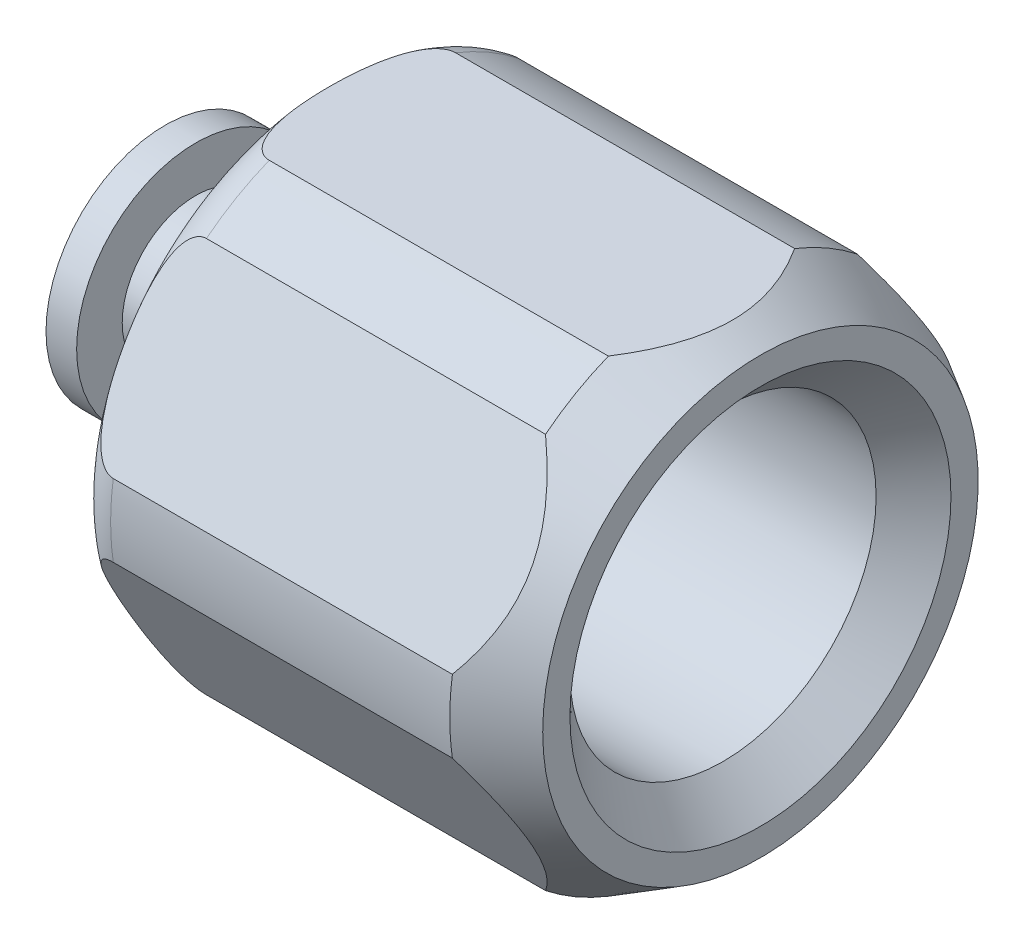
ISO-10303-21;
HEADER;
FILE_DESCRIPTION(('STEP AP214'),'2;1');
FILE_NAME('part.step','',(''),(''),'','','');
FILE_SCHEMA(('AUTOMOTIVE_DESIGN { 1 0 10303 214 1 1 1 1 }'));
ENDSEC;
DATA;
#1=APPLICATION_CONTEXT('core data for automotive mechanical design processes');
#2=APPLICATION_PROTOCOL_DEFINITION('international standard','automotive_design',2000,#1);
#3=PRODUCT_CONTEXT('',#1,'mechanical');
#4=PRODUCT('Part','Part','',(#3));
#5=PRODUCT_RELATED_PRODUCT_CATEGORY('part','',(#4));
#6=PRODUCT_DEFINITION_FORMATION('','',#4);
#7=PRODUCT_DEFINITION_CONTEXT('part definition',#1,'design');
#8=PRODUCT_DEFINITION('design','',#6,#7);
#9=PRODUCT_DEFINITION_SHAPE('','',#8);
#10=(LENGTH_UNIT() NAMED_UNIT(*) SI_UNIT(.MILLI.,.METRE.));
#11=(NAMED_UNIT(*) PLANE_ANGLE_UNIT() SI_UNIT($,.RADIAN.));
#12=(NAMED_UNIT(*) SI_UNIT($,.STERADIAN.) SOLID_ANGLE_UNIT());
#13=UNCERTAINTY_MEASURE_WITH_UNIT(LENGTH_MEASURE(1.E-05),#10,'distance_accuracy_value','');
#14=(GEOMETRIC_REPRESENTATION_CONTEXT(3) GLOBAL_UNCERTAINTY_ASSIGNED_CONTEXT((#13)) GLOBAL_UNIT_ASSIGNED_CONTEXT((#10,
#11,#12)) REPRESENTATION_CONTEXT('',''));
#15=CARTESIAN_POINT('',(0.,0.,0.));
#16=DIRECTION('',(0.,0.,1.));
#17=DIRECTION('',(1.,0.,0.));
#18=AXIS2_PLACEMENT_3D('',#15,#16,#17);
#19=CARTESIAN_POINT('',(20.0252954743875,0.,0.));
#20=DIRECTION('',(-1.,0.,0.));
#21=DIRECTION('',(0.,0.,1.));
#22=AXIS2_PLACEMENT_3D('',#19,#20,#21);
#23=CONICAL_SURFACE('',#22,9.398,0.5235987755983);
#24=CARTESIAN_POINT('',(22.225,0.,0.));
#25=DIRECTION('',(-1.,0.,0.));
#26=DIRECTION('',(0.,0.,1.));
#27=AXIS2_PLACEMENT_3D('',#24,#25,#26);
#28=CIRCLE('',#27,8.128);
#29=CARTESIAN_POINT('',(22.225,0.,8.128));
#30=VERTEX_POINT('',#29);
#31=EDGE_CURVE('E307',#30,#30,#28,.T.);
#32=ORIENTED_EDGE('',*,*,#31,.T.);
#33=EDGE_LOOP('',(#32));
#34=FACE_BOUND('',#33,.T.);
#35=CARTESIAN_POINT('',(20.0252954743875,0.,0.));
#36=DIRECTION('',(-1.,0.,0.));
#37=DIRECTION('',(0.,0.,1.));
#38=AXIS2_PLACEMENT_3D('',#35,#36,#37);
#39=CIRCLE('',#38,9.398);
#40=CARTESIAN_POINT('',(20.0252954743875,1.35468526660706,-9.29985117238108));
#41=VERTEX_POINT('',#40);
#42=CARTESIAN_POINT('',(20.0252954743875,-1.35468526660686,-9.29985117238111));
#43=VERTEX_POINT('',#42);
#44=EDGE_CURVE('E372',#41,#43,#39,.T.);
#45=ORIENTED_EDGE('',*,*,#44,.F.);
#46=CARTESIAN_POINT('',(20.0250954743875,1.35441496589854,-9.30000723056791));
#47=CARTESIAN_POINT('',(20.1275722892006,1.4929613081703,-9.22001746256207));
#48=CARTESIAN_POINT('',(20.2258479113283,1.63397724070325,-9.13860187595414));
#49=CARTESIAN_POINT('',(20.4121352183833,1.9215766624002,-8.97255627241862));
#50=CARTESIAN_POINT('',(20.5001131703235,2.06817647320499,-8.88791683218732));
#51=CARTESIAN_POINT('',(20.6641792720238,2.36836844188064,-8.71460091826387));
#52=CARTESIAN_POINT('',(20.7401226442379,2.52202067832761,-8.62588975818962));
#53=CARTESIAN_POINT('',(20.8761469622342,2.83431529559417,-8.44558637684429));
#54=CARTESIAN_POINT('',(20.9362516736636,2.99294979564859,-8.35399870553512));
#55=CARTESIAN_POINT('',(21.0261988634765,3.27714125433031,-8.18992069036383));
#56=CARTESIAN_POINT('',(21.0598290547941,3.40179971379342,-8.11794909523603));
#57=CARTESIAN_POINT('',(21.1152011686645,3.65311005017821,-7.97285500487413));
#58=CARTESIAN_POINT('',(21.1369427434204,3.77976198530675,-7.89973247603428));
#59=CARTESIAN_POINT('',(21.1676562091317,4.03341986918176,-7.75328302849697));
#60=CARTESIAN_POINT('',(21.1767081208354,4.16041849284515,-7.6799603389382));
#61=CARTESIAN_POINT('',(21.1819589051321,4.41461306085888,-7.53320103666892));
#62=CARTESIAN_POINT('',(21.178158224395,4.54180899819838,-7.45976442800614));
#63=CARTESIAN_POINT('',(21.1578579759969,4.79532752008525,-7.31339544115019));
#64=CARTESIAN_POINT('',(21.1413686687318,4.92165072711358,-7.24046270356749));
#65=CARTESIAN_POINT('',(21.0963050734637,5.17266174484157,-7.09554142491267));
#66=CARTESIAN_POINT('',(21.0677299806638,5.29734944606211,-7.02355294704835));
#67=CARTESIAN_POINT('',(20.9992486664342,5.54508619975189,-6.88052206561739));
#68=CARTESIAN_POINT('',(20.9592802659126,5.66812226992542,-6.80948715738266));
#69=CARTESIAN_POINT('',(20.8692283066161,5.91140240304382,-6.66902930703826));
#70=CARTESIAN_POINT('',(20.8191407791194,6.03164534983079,-6.59960700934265));
#71=CARTESIAN_POINT('',(20.6654565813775,6.36615083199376,-6.40648017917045));
#72=CARTESIAN_POINT('',(20.5515907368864,6.57691258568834,-6.28479682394));
#73=CARTESIAN_POINT('',(20.3646430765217,6.88396076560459,-6.10752247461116));
#74=CARTESIAN_POINT('',(20.3000303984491,6.98427266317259,-6.04960737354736));
#75=CARTESIAN_POINT('',(20.1660065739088,7.18238241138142,-5.9352286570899));
#76=CARTESIAN_POINT('',(20.0965984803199,7.28018180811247,-5.87876414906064));
#77=CARTESIAN_POINT('',(20.0250954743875,7.37683503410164,-5.82296138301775));
#78=B_SPLINE_CURVE_WITH_KNOTS('',3,(#46,#47,#48,#49,#50,#51,#52,#53,#54,#55,#56,#57,#58,#59,#60,
#61,#62,#63,#64,#65,#66,#67,#68,#69,#70,#71,#72,#73,#74,#75,#76,#77),.UNSPECIFIED.,.F.,.F.,(4,2,
2,2,2,2,2,2,2,2,2,2,2,2,2,4),(0.,0.570096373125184,1.14201088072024,1.72035458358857,
2.29782548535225,2.74083821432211,3.1838639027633,3.62408311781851,4.06428703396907,
4.50413536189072,4.94401298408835,5.3863387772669,5.8288383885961,6.63309300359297,
7.03091274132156,7.42848151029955),.UNSPECIFIED.);
#79=CARTESIAN_POINT('',(20.0252954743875,7.37656473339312,-5.82311744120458));
#80=VERTEX_POINT('',#79);
#81=EDGE_CURVE('E52',#41,#80,#78,.T.);
#82=ORIENTED_EDGE('',*,*,#81,.T.);
#83=CARTESIAN_POINT('',(20.0252954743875,8.73125,-3.47673373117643));
#84=VERTEX_POINT('',#83);
#85=EDGE_CURVE('E158',#84,#80,#39,.T.);
#86=ORIENTED_EDGE('',*,*,#85,.F.);
#87=CARTESIAN_POINT('',(10.8904738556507,8.73125,-11.7912092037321));
#88=CARTESIAN_POINT('',(11.1742916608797,8.73125,-11.5872907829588));
#89=CARTESIAN_POINT('',(11.4572464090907,8.73125,-11.3821614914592));
#90=CARTESIAN_POINT('',(12.0211006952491,8.73125,-10.9690575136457));
#91=CARTESIAN_POINT('',(12.3020000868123,8.73125,-10.7610826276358));
#92=CARTESIAN_POINT('',(12.8620107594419,8.73125,-10.3414155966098));
#93=CARTESIAN_POINT('',(13.1411165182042,8.73125,-10.129716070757));
#94=CARTESIAN_POINT('',(13.6964190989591,8.73125,-9.70254352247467));
#95=CARTESIAN_POINT('',(13.9726159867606,8.73125,-9.48707058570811));
#96=CARTESIAN_POINT('',(14.5345238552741,8.73125,-9.04139511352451));
#97=CARTESIAN_POINT('',(14.8200653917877,8.73125,-8.81097846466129));
#98=CARTESIAN_POINT('',(15.3864133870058,8.73125,-8.3444012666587));
#99=CARTESIAN_POINT('',(15.6672199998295,8.73125,-8.10824090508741));
#100=CARTESIAN_POINT('',(16.2226384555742,8.73125,-7.62924311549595));
#101=CARTESIAN_POINT('',(16.4972558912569,8.73125,-7.38641219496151));
#102=CARTESIAN_POINT('',(17.0388691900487,8.73125,-6.89242338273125));
#103=CARTESIAN_POINT('',(17.305866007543,8.73125,-6.64126654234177));
#104=CARTESIAN_POINT('',(17.8350046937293,8.73125,-6.12373220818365));
#105=CARTESIAN_POINT('',(18.0969511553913,8.73125,-5.85715369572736));
#106=CARTESIAN_POINT('',(18.6070146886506,8.73125,-5.31058236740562));
#107=CARTESIAN_POINT('',(18.8551217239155,8.73125,-5.0305800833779));
#108=CARTESIAN_POINT('',(19.328757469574,8.73125,-4.45767066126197));
#109=CARTESIAN_POINT('',(19.5545243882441,8.73125,-4.16496225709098));
#110=CARTESIAN_POINT('',(19.9782467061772,8.73125,-3.56023822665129));
#111=CARTESIAN_POINT('',(20.1762506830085,8.73125,-3.2482577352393));
#112=CARTESIAN_POINT('',(20.4215807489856,8.73125,-2.80233423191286));
#113=CARTESIAN_POINT('',(20.4862406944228,8.73125,-2.67787538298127));
#114=CARTESIAN_POINT('',(20.6089312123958,8.73125,-2.42536878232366));
#115=CARTESIAN_POINT('',(20.6669468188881,8.73125,-2.29731370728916));
#116=CARTESIAN_POINT('',(20.7805292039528,8.73125,-2.02514445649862));
#117=CARTESIAN_POINT('',(20.8352909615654,8.73125,-1.88069149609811));
#118=CARTESIAN_POINT('',(20.934013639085,8.73125,-1.58814619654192));
#119=CARTESIAN_POINT('',(20.9779768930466,8.73125,-1.44005465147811));
#120=CARTESIAN_POINT('',(21.05373188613,8.73125,-1.14089421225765));
#121=CARTESIAN_POINT('',(21.0855338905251,8.73125,-0.989827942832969));
#122=CARTESIAN_POINT('',(21.1358716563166,8.73125,-0.68549338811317));
#123=CARTESIAN_POINT('',(21.154408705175,8.73125,-0.532225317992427));
#124=CARTESIAN_POINT('',(21.1775525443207,8.73125,-0.223618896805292));
#125=CARTESIAN_POINT('',(21.1820673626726,8.73125,-0.0682735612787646));
#126=CARTESIAN_POINT('',(21.1767137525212,8.73125,0.242165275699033));
#127=CARTESIAN_POINT('',(21.166845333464,8.73125,0.397258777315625));
#128=CARTESIAN_POINT('',(21.133145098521,8.73125,0.705874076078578));
#129=CARTESIAN_POINT('',(21.1093161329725,8.73125,0.859396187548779));
#130=CARTESIAN_POINT('',(21.048632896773,8.73125,1.16383226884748));
#131=CARTESIAN_POINT('',(21.0117767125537,8.73125,1.31474585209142));
#132=CARTESIAN_POINT('',(20.9133625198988,8.73125,1.6583446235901));
#133=CARTESIAN_POINT('',(20.8477047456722,8.73125,1.84985546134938));
#134=CARTESIAN_POINT('',(20.6995367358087,8.73125,2.22622514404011));
#135=CARTESIAN_POINT('',(20.617019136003,8.73125,2.41108104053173));
#136=CARTESIAN_POINT('',(20.4372155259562,8.73125,2.77579148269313));
#137=CARTESIAN_POINT('',(20.3397850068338,8.73125,2.95557412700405));
#138=CARTESIAN_POINT('',(20.1334944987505,8.73125,3.30831744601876));
#139=CARTESIAN_POINT('',(20.0246379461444,8.73125,3.48128015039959));
#140=CARTESIAN_POINT('',(19.7473184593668,8.73125,3.8963132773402));
#141=CARTESIAN_POINT('',(19.5738298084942,8.73125,4.13501603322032));
#142=CARTESIAN_POINT('',(19.2124486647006,8.73125,4.60133686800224));
#143=CARTESIAN_POINT('',(19.0245472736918,8.73125,4.82894795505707));
#144=CARTESIAN_POINT('',(18.6371893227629,8.73125,5.27550746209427));
#145=CARTESIAN_POINT('',(18.4376932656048,8.73125,5.49442140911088));
#146=CARTESIAN_POINT('',(18.0303263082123,8.73125,5.9241695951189));
#147=CARTESIAN_POINT('',(17.8224573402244,8.73125,6.13500567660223));
#148=CARTESIAN_POINT('',(17.4128413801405,8.73125,6.53739477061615));
#149=CARTESIAN_POINT('',(17.2114816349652,8.73125,6.72934374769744));
#150=CARTESIAN_POINT('',(16.8040011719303,8.73125,7.10814299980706));
#151=CARTESIAN_POINT('',(16.5978800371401,8.73125,7.29499282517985));
#152=CARTESIAN_POINT('',(16.1835523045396,8.73125,7.66269004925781));
#153=CARTESIAN_POINT('',(15.9753793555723,8.73125,7.84357547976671));
#154=CARTESIAN_POINT('',(15.5558692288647,8.73125,8.2015316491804));
#155=CARTESIAN_POINT('',(15.3445328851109,8.73125,8.37860336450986));
#156=CARTESIAN_POINT('',(15.1318909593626,8.73125,8.55406905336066));
#157=B_SPLINE_CURVE_WITH_KNOTS('',3,(#87,#88,#89,#90,#91,#92,#93,#94,#95,#96,#97,#98,#99,#100,
#101,#102,#103,#104,#105,#106,#107,#108,#109,#110,#111,#112,#113,#114,#115,#116,#117,#118,#119,
#120,#121,#122,#123,#124,#125,#126,#127,#128,#129,#130,#131,#132,#133,#134,#135,#136,#137,#138,
#139,#140,#141,#142,#143,#144,#145,#146,#147,#148,#149,#150,#151,#152,#153,#154,#155,#156),
.UNSPECIFIED.,.F.,.F.,(4,2,2,2,2,2,2,2,2,2,2,2,2,2,2,2,2,2,2,2,2,2,2,2,2,2,2,2,2,2,2,2,2,2,4),
(0.,1.04844089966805,2.09695575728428,3.14785616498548,4.19873274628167,5.29941230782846,
6.40005597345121,7.49966157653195,8.59912885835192,9.71997881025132,10.8416313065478,
11.9496212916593,13.0556477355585,13.4762445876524,13.8977709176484,14.3608458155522,
14.8238205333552,15.2864035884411,15.7489417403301,16.2145073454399,16.6800726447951,
17.1455429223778,17.6110816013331,18.2174525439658,18.8240889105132,19.4370269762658,
20.0497812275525,20.9342666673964,21.8193026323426,22.707553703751,23.5956009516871,
24.4300721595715,25.2646167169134,26.091914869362,26.9189986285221),.UNSPECIFIED.);
#158=CARTESIAN_POINT('',(20.0252954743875,8.73125,3.47673373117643));
#159=VERTEX_POINT('',#158);
#160=EDGE_CURVE('E298',#84,#159,#157,.T.);
#161=ORIENTED_EDGE('',*,*,#160,.T.);
#162=CARTESIAN_POINT('',(20.0252954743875,7.37656473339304,5.82311744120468));
#163=VERTEX_POINT('',#162);
#164=EDGE_CURVE('E151',#163,#159,#39,.T.);
#165=ORIENTED_EDGE('',*,*,#164,.F.);
#166=CARTESIAN_POINT('',(20.0250954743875,7.37683503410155,5.82296138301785));
#167=CARTESIAN_POINT('',(20.1275722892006,7.2382886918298,5.90295115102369));
#168=CARTESIAN_POINT('',(20.2258479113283,7.09727275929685,5.98436673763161));
#169=CARTESIAN_POINT('',(20.4121352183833,6.80967333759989,6.15041234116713));
#170=CARTESIAN_POINT('',(20.5001131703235,6.6630735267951,6.23505178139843));
#171=CARTESIAN_POINT('',(20.6641792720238,6.36288155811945,6.40836769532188));
#172=CARTESIAN_POINT('',(20.7401226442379,6.20922932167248,6.49707885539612));
#173=CARTESIAN_POINT('',(20.8761469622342,5.89693470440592,6.67738223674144));
#174=CARTESIAN_POINT('',(20.9362516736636,5.7383002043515,6.76896990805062));
#175=CARTESIAN_POINT('',(21.0261988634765,5.45410874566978,6.93304792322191));
#176=CARTESIAN_POINT('',(21.0598290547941,5.32945028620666,7.0050195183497));
#177=CARTESIAN_POINT('',(21.1152011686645,5.07813994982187,7.15011360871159));
#178=CARTESIAN_POINT('',(21.1369427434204,4.95148801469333,7.22323613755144));
#179=CARTESIAN_POINT('',(21.1676562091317,4.69783013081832,7.36968558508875));
#180=CARTESIAN_POINT('',(21.1767081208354,4.57083150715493,7.44300827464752));
#181=CARTESIAN_POINT('',(21.1819589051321,4.31663693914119,7.58976757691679));
#182=CARTESIAN_POINT('',(21.178158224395,4.18944100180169,7.66320418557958));
#183=CARTESIAN_POINT('',(21.1578579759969,3.93592247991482,7.80957317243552));
#184=CARTESIAN_POINT('',(21.1413686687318,3.8095992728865,7.88250591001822));
#185=CARTESIAN_POINT('',(21.0963050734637,3.5585882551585,8.02742718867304));
#186=CARTESIAN_POINT('',(21.0677299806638,3.43390055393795,8.09941566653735));
#187=CARTESIAN_POINT('',(20.9992486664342,3.18616380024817,8.24244654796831));
#188=CARTESIAN_POINT('',(20.9592802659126,3.06312773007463,8.31348145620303));
#189=CARTESIAN_POINT('',(20.8692283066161,2.81984759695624,8.45393930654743));
#190=CARTESIAN_POINT('',(20.8191407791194,2.69960465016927,8.52336160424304));
#191=CARTESIAN_POINT('',(20.6654565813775,2.3650991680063,8.71648843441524));
#192=CARTESIAN_POINT('',(20.5515907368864,2.15433741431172,8.83817178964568));
#193=CARTESIAN_POINT('',(20.3646430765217,1.84728923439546,9.01544613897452));
#194=CARTESIAN_POINT('',(20.3000303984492,1.74697733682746,9.07336124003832));
#195=CARTESIAN_POINT('',(20.1660065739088,1.54886758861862,9.18773995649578));
#196=CARTESIAN_POINT('',(20.0965984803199,1.45106819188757,9.24420446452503));
#197=CARTESIAN_POINT('',(20.0250954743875,1.35441496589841,9.30000723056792));
#198=B_SPLINE_CURVE_WITH_KNOTS('',3,(#166,#167,#168,#169,#170,#171,#172,#173,#174,#175,#176,
#177,#178,#179,#180,#181,#182,#183,#184,#185,#186,#187,#188,#189,#190,#191,#192,#193,#194,#195,
#196,#197),.UNSPECIFIED.,.F.,.F.,(4,2,2,2,2,2,2,2,2,2,2,2,2,2,2,4),(0.,0.570096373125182,
1.14201088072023,1.72035458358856,2.29782548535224,2.7408382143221,3.18386390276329,
3.62408311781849,4.06428703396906,4.50413536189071,4.94401298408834,5.38633877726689,
5.82883838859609,6.63309300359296,7.03091274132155,7.42848151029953),.UNSPECIFIED.);
#199=CARTESIAN_POINT('',(20.0252954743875,1.35468526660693,9.2998511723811));
#200=VERTEX_POINT('',#199);
#201=EDGE_CURVE('E488',#163,#200,#198,.T.);
#202=ORIENTED_EDGE('',*,*,#201,.T.);
#203=CARTESIAN_POINT('',(20.0252954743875,-1.35468526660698,9.29985117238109));
#204=VERTEX_POINT('',#203);
#205=EDGE_CURVE('E400',#204,#200,#39,.T.);
#206=ORIENTED_EDGE('',*,*,#205,.F.);
#207=CARTESIAN_POINT('',(20.0250954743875,-1.35441496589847,9.30000723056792));
#208=CARTESIAN_POINT('',(20.1275722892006,-1.49296130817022,9.22001746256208));
#209=CARTESIAN_POINT('',(20.2258479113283,-1.63397724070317,9.13860187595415));
#210=CARTESIAN_POINT('',(20.4121352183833,-1.92157666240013,8.97255627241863));
#211=CARTESIAN_POINT('',(20.5001131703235,-2.06817647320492,8.88791683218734));
#212=CARTESIAN_POINT('',(20.6641792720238,-2.36836844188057,8.71460091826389));
#213=CARTESIAN_POINT('',(20.7401226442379,-2.52202067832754,8.62588975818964));
#214=CARTESIAN_POINT('',(20.8761469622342,-2.8343152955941,8.44558637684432));
#215=CARTESIAN_POINT('',(20.9362516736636,-2.99294979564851,8.35399870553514));
#216=CARTESIAN_POINT('',(21.0261988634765,-3.27714125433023,8.18992069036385));
#217=CARTESIAN_POINT('',(21.0598290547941,-3.40179971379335,8.11794909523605));
#218=CARTESIAN_POINT('',(21.1152011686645,-3.65311005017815,7.97285500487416));
#219=CARTESIAN_POINT('',(21.1369427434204,-3.77976198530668,7.89973247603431));
#220=CARTESIAN_POINT('',(21.1676562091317,-4.03341986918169,7.753283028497));
#221=CARTESIAN_POINT('',(21.1767081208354,-4.16041849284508,7.67996033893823));
#222=CARTESIAN_POINT('',(21.1819589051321,-4.41461306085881,7.53320103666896));
#223=CARTESIAN_POINT('',(21.178158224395,-4.54180899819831,7.45976442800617));
#224=CARTESIAN_POINT('',(21.157857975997,-4.79532752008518,7.31339544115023));
#225=CARTESIAN_POINT('',(21.1413686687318,-4.92165072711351,7.24046270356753));
#226=CARTESIAN_POINT('',(21.0963050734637,-5.1726617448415,7.0955414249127));
#227=CARTESIAN_POINT('',(21.0677299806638,-5.29734944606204,7.02355294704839));
#228=CARTESIAN_POINT('',(20.9992486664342,-5.54508619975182,6.88052206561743));
#229=CARTESIAN_POINT('',(20.9592802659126,-5.66812226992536,6.8094871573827));
#230=CARTESIAN_POINT('',(20.8692283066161,-5.91140240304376,6.66902930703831));
#231=CARTESIAN_POINT('',(20.8191407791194,-6.03164534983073,6.5996070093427));
#232=CARTESIAN_POINT('',(20.6654565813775,-6.3661508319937,6.4064801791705));
#233=CARTESIAN_POINT('',(20.5515907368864,-6.57691258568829,6.28479682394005));
#234=CARTESIAN_POINT('',(20.3646430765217,-6.88396076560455,6.10752247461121));
#235=CARTESIAN_POINT('',(20.3000303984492,-6.98427266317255,6.0496073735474));
#236=CARTESIAN_POINT('',(20.1660065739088,-7.18238241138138,5.93522865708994));
#237=CARTESIAN_POINT('',(20.0965984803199,-7.28018180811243,5.87876414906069));
#238=CARTESIAN_POINT('',(20.0250954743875,-7.3768350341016,5.8229613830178));
#239=B_SPLINE_CURVE_WITH_KNOTS('',3,(#207,#208,#209,#210,#211,#212,#213,#214,#215,#216,#217,
#218,#219,#220,#221,#222,#223,#224,#225,#226,#227,#228,#229,#230,#231,#232,#233,#234,#235,#236,
#237,#238),.UNSPECIFIED.,.F.,.F.,(4,2,2,2,2,2,2,2,2,2,2,2,2,2,2,4),(0.,0.570096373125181,
1.14201088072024,1.72035458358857,2.29782548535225,2.74083821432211,3.18386390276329,
3.6240831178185,4.06428703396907,4.50413536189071,4.94401298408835,5.38633877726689,
5.8288383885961,6.63309300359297,7.03091274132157,7.42848151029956),.UNSPECIFIED.);
#240=CARTESIAN_POINT('',(20.0252954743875,-7.37656473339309,5.82311744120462));
#241=VERTEX_POINT('',#240);
#242=EDGE_CURVE('E233',#204,#241,#239,.T.);
#243=ORIENTED_EDGE('',*,*,#242,.T.);
#244=CARTESIAN_POINT('',(20.0252954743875,-8.73125000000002,3.47673373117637));
#245=VERTEX_POINT('',#244);
#246=EDGE_CURVE('E392',#245,#241,#39,.T.);
#247=ORIENTED_EDGE('',*,*,#246,.F.);
#248=CARTESIAN_POINT('',(10.8904738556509,-8.73124999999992,-11.7912092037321));
#249=CARTESIAN_POINT('',(11.1742916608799,-8.73124999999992,-11.5872907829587));
#250=CARTESIAN_POINT('',(11.4572464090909,-8.73124999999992,-11.3821614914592));
#251=CARTESIAN_POINT('',(12.0211006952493,-8.73124999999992,-10.9690575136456));
#252=CARTESIAN_POINT('',(12.3020000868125,-8.73124999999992,-10.7610826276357));
#253=CARTESIAN_POINT('',(12.8620107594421,-8.73124999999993,-10.3414155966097));
#254=CARTESIAN_POINT('',(13.1411165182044,-8.73124999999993,-10.1297160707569));
#255=CARTESIAN_POINT('',(13.6964190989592,-8.73124999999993,-9.70254352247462));
#256=CARTESIAN_POINT('',(13.9726159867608,-8.73124999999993,-9.48707058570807));
#257=CARTESIAN_POINT('',(14.5345238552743,-8.73124999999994,-9.04139511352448));
#258=CARTESIAN_POINT('',(14.8200653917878,-8.73124999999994,-8.81097846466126));
#259=CARTESIAN_POINT('',(15.3864133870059,-8.73124999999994,-8.34440126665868));
#260=CARTESIAN_POINT('',(15.6672199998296,-8.73124999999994,-8.1082409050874));
#261=CARTESIAN_POINT('',(16.2226384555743,-8.73124999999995,-7.62924311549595));
#262=CARTESIAN_POINT('',(16.497255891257,-8.73124999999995,-7.38641219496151));
#263=CARTESIAN_POINT('',(17.0388691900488,-8.73124999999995,-6.89242338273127));
#264=CARTESIAN_POINT('',(17.3058660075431,-8.73124999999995,-6.64126654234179));
#265=CARTESIAN_POINT('',(17.8350046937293,-8.73124999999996,-6.12373220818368));
#266=CARTESIAN_POINT('',(18.0969511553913,-8.73124999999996,-5.8571536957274));
#267=CARTESIAN_POINT('',(18.6070146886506,-8.73124999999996,-5.31058236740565));
#268=CARTESIAN_POINT('',(18.8551217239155,-8.73124999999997,-5.03058008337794));
#269=CARTESIAN_POINT('',(19.328757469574,-8.73124999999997,-4.45767066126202));
#270=CARTESIAN_POINT('',(19.5545243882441,-8.73124999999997,-4.16496225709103));
#271=CARTESIAN_POINT('',(19.9782467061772,-8.73124999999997,-3.56023822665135));
#272=CARTESIAN_POINT('',(20.1762506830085,-8.73124999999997,-3.24825773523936));
#273=CARTESIAN_POINT('',(20.4215807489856,-8.73124999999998,-2.80233423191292));
#274=CARTESIAN_POINT('',(20.4862406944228,-8.73124999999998,-2.67787538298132));
#275=CARTESIAN_POINT('',(20.6089312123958,-8.73124999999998,-2.42536878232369));
#276=CARTESIAN_POINT('',(20.6669468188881,-8.73124999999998,-2.29731370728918));
#277=CARTESIAN_POINT('',(20.7805292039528,-8.73124999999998,-2.02514445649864));
#278=CARTESIAN_POINT('',(20.8352909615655,-8.73124999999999,-1.88069149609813));
#279=CARTESIAN_POINT('',(20.934013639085,-8.73124999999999,-1.58814619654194));
#280=CARTESIAN_POINT('',(20.9779768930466,-8.73124999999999,-1.44005465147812));
#281=CARTESIAN_POINT('',(21.05373188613,-8.73124999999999,-1.14089421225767));
#282=CARTESIAN_POINT('',(21.0855338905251,-8.73124999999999,-0.989827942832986));
#283=CARTESIAN_POINT('',(21.1358716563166,-8.73125,-0.685493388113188));
#284=CARTESIAN_POINT('',(21.154408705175,-8.73125,-0.532225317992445));
#285=CARTESIAN_POINT('',(21.1775525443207,-8.73125,-0.223618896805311));
#286=CARTESIAN_POINT('',(21.1820673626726,-8.73125,-0.0682735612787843));
#287=CARTESIAN_POINT('',(21.1767137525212,-8.73125,0.242165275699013));
#288=CARTESIAN_POINT('',(21.166845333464,-8.73125,0.397258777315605));
#289=CARTESIAN_POINT('',(21.133145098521,-8.73125,0.705874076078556));
#290=CARTESIAN_POINT('',(21.1093161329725,-8.73125,0.859396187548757));
#291=CARTESIAN_POINT('',(21.048632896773,-8.73125000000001,1.16383226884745));
#292=CARTESIAN_POINT('',(21.0117767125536,-8.73125000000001,1.3147458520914));
#293=CARTESIAN_POINT('',(20.9133625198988,-8.73125000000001,1.65834462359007));
#294=CARTESIAN_POINT('',(20.8477047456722,-8.73125000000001,1.84985546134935));
#295=CARTESIAN_POINT('',(20.6995367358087,-8.73125000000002,2.22622514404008));
#296=CARTESIAN_POINT('',(20.617019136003,-8.73125000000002,2.41108104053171));
#297=CARTESIAN_POINT('',(20.4372155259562,-8.73125000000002,2.77579148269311));
#298=CARTESIAN_POINT('',(20.3397850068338,-8.73125000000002,2.95557412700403));
#299=CARTESIAN_POINT('',(20.1334944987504,-8.73125000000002,3.30831744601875));
#300=CARTESIAN_POINT('',(20.0246379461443,-8.73125000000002,3.48128015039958));
#301=CARTESIAN_POINT('',(19.7473184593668,-8.73125000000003,3.89631327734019));
#302=CARTESIAN_POINT('',(19.5738298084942,-8.73125000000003,4.13501603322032));
#303=CARTESIAN_POINT('',(19.2124486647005,-8.73125000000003,4.60133686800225));
#304=CARTESIAN_POINT('',(19.0245472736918,-8.73125000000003,4.82894795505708));
#305=CARTESIAN_POINT('',(18.6371893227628,-8.73125000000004,5.27550746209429));
#306=CARTESIAN_POINT('',(18.4376932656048,-8.73125000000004,5.4944214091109));
#307=CARTESIAN_POINT('',(18.0303263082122,-8.73125000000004,5.92416959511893));
#308=CARTESIAN_POINT('',(17.8224573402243,-8.73125000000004,6.13500567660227));
#309=CARTESIAN_POINT('',(17.4128413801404,-8.73125000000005,6.53739477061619));
#310=CARTESIAN_POINT('',(17.2114816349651,-8.73125000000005,6.72934374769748));
#311=CARTESIAN_POINT('',(16.8040011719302,-8.73125000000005,7.10814299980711));
#312=CARTESIAN_POINT('',(16.5978800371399,-8.73125000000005,7.29499282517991));
#313=CARTESIAN_POINT('',(16.1835523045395,-8.73125000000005,7.66269004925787));
#314=CARTESIAN_POINT('',(15.9753793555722,-8.73125000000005,7.84357547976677));
#315=CARTESIAN_POINT('',(15.5558692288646,-8.73125000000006,8.20153164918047));
#316=CARTESIAN_POINT('',(15.3445328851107,-8.73125000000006,8.37860336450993));
#317=CARTESIAN_POINT('',(15.1318909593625,-8.73125000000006,8.55406905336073));
#318=B_SPLINE_CURVE_WITH_KNOTS('',3,(#248,#249,#250,#251,#252,#253,#254,#255,#256,#257,#258,
#259,#260,#261,#262,#263,#264,#265,#266,#267,#268,#269,#270,#271,#272,#273,#274,#275,#276,#277,
#278,#279,#280,#281,#282,#283,#284,#285,#286,#287,#288,#289,#290,#291,#292,#293,#294,#295,#296,
#297,#298,#299,#300,#301,#302,#303,#304,#305,#306,#307,#308,#309,#310,#311,#312,#313,#314,#315,
#316,#317),.UNSPECIFIED.,.F.,.F.,(4,2,2,2,2,2,2,2,2,2,2,2,2,2,2,2,2,2,2,2,2,2,2,2,2,2,2,2,2,2,2,
2,2,2,4),(0.,1.04844089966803,2.09695575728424,3.14785616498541,4.19873274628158,
5.29941230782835,6.40005597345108,7.49966157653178,8.59912885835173,9.71997881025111,
10.8416313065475,11.949621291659,13.0556477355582,13.4762445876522,13.8977709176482,
14.360845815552,14.823820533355,15.2864035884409,15.7489417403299,16.2145073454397,
16.6800726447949,17.1455429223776,17.6110816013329,18.2174525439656,18.824088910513,
19.4370269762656,20.0497812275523,20.9342666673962,21.8193026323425,22.7075537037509,
23.595600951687,24.4300721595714,25.2646167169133,26.0919148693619,26.9189986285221),.UNSPECIFIED.);
#319=CARTESIAN_POINT('',(20.0252954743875,-8.73124999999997,-3.4767337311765));
#320=VERTEX_POINT('',#319);
#321=EDGE_CURVE('E218',#245,#320,#318,.F.);
#322=ORIENTED_EDGE('',*,*,#321,.T.);
#323=CARTESIAN_POINT('',(20.0252954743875,-7.376564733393,-5.82311744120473));
#324=VERTEX_POINT('',#323);
#325=EDGE_CURVE('E425',#324,#320,#39,.T.);
#326=ORIENTED_EDGE('',*,*,#325,.F.);
#327=CARTESIAN_POINT('',(20.0250954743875,-7.37683503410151,-5.82296138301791));
#328=CARTESIAN_POINT('',(20.1275722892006,-7.23828869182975,-5.90295115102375));
#329=CARTESIAN_POINT('',(20.2258479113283,-7.0972727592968,-5.98436673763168));
#330=CARTESIAN_POINT('',(20.4121352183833,-6.80967333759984,-6.15041234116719));
#331=CARTESIAN_POINT('',(20.5001131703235,-6.66307352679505,-6.23505178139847));
#332=CARTESIAN_POINT('',(20.6641792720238,-6.3628815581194,-6.40836769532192));
#333=CARTESIAN_POINT('',(20.7401226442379,-6.20922932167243,-6.49707885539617));
#334=CARTESIAN_POINT('',(20.8761469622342,-5.89693470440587,-6.67738223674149));
#335=CARTESIAN_POINT('',(20.9362516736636,-5.73830020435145,-6.76896990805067));
#336=CARTESIAN_POINT('',(21.0261988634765,-5.45410874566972,-6.93304792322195));
#337=CARTESIAN_POINT('',(21.0598290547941,-5.32945028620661,-7.00501951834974));
#338=CARTESIAN_POINT('',(21.1152011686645,-5.07813994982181,-7.15011360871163));
#339=CARTESIAN_POINT('',(21.1369427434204,-4.95148801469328,-7.22323613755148));
#340=CARTESIAN_POINT('',(21.1676562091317,-4.69783013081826,-7.36968558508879));
#341=CARTESIAN_POINT('',(21.1767081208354,-4.57083150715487,-7.44300827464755));
#342=CARTESIAN_POINT('',(21.1819589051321,-4.31663693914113,-7.58976757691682));
#343=CARTESIAN_POINT('',(21.178158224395,-4.18944100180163,-7.66320418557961));
#344=CARTESIAN_POINT('',(21.1578579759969,-3.93592247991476,-7.80957317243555));
#345=CARTESIAN_POINT('',(21.1413686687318,-3.80959927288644,-7.88250591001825));
#346=CARTESIAN_POINT('',(21.0963050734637,-3.55858825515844,-8.02742718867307));
#347=CARTESIAN_POINT('',(21.0677299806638,-3.4339005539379,-8.09941566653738));
#348=CARTESIAN_POINT('',(20.9992486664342,-3.18616380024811,-8.24244654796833));
#349=CARTESIAN_POINT('',(20.9592802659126,-3.06312773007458,-8.31348145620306));
#350=CARTESIAN_POINT('',(20.8692283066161,-2.81984759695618,-8.45393930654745));
#351=CARTESIAN_POINT('',(20.8191407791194,-2.69960465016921,-8.52336160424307));
#352=CARTESIAN_POINT('',(20.6654565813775,-2.36509916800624,-8.71648843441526));
#353=CARTESIAN_POINT('',(20.5515907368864,-2.15433741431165,-8.8381717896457));
#354=CARTESIAN_POINT('',(20.3646430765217,-1.8472892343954,-9.01544613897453));
#355=CARTESIAN_POINT('',(20.3000303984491,-1.7469773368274,-9.07336124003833));
#356=CARTESIAN_POINT('',(20.1660065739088,-1.54886758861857,-9.18773995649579));
#357=CARTESIAN_POINT('',(20.0965984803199,-1.45106819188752,-9.24420446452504));
#358=CARTESIAN_POINT('',(20.0250954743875,-1.35441496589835,-9.30000723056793));
#359=B_SPLINE_CURVE_WITH_KNOTS('',3,(#327,#328,#329,#330,#331,#332,#333,#334,#335,#336,#337,
#338,#339,#340,#341,#342,#343,#344,#345,#346,#347,#348,#349,#350,#351,#352,#353,#354,#355,#356,
#357,#358),.UNSPECIFIED.,.F.,.F.,(4,2,2,2,2,2,2,2,2,2,2,2,2,2,2,4),(0.,0.57009637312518,
1.14201088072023,1.72035458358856,2.29782548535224,2.7408382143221,3.18386390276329,
3.62408311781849,4.06428703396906,4.50413536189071,4.94401298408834,5.38633877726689,
5.82883838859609,6.63309300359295,7.03091274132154,7.42848151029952),.UNSPECIFIED.);
#360=EDGE_CURVE('E202',#324,#43,#359,.T.);
#361=ORIENTED_EDGE('',*,*,#360,.T.);
#362=EDGE_LOOP('',(#45,#82,#86,#161,#165,#202,#206,#243,#247,#322,#326,#361));
#363=FACE_BOUND('',#362,.T.);
#364=ADVANCED_FACE('F16',(#34,#363),#23,.T.);
#365=CARTESIAN_POINT('',(0.,0.,0.));
#366=DIRECTION('',(-1.,0.,0.));
#367=DIRECTION('',(0.,0.,1.));
#368=AXIS2_PLACEMENT_3D('',#365,#366,#367);
#369=CYLINDRICAL_SURFACE('',#368,9.398);
#370=CARTESIAN_POINT('',(7.366,0.,0.));
#371=DIRECTION('',(-1.,0.,0.));
#372=DIRECTION('',(0.,0.,1.));
#373=AXIS2_PLACEMENT_3D('',#370,#371,#372);
#374=CIRCLE('',#373,9.398);
#375=CARTESIAN_POINT('',(7.366,1.35468526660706,-9.29985117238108));
#376=VERTEX_POINT('',#375);
#377=CARTESIAN_POINT('',(7.36599999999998,-1.35468526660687,-9.29985117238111));
#378=VERTEX_POINT('',#377);
#379=EDGE_CURVE('E152',#376,#378,#374,.T.);
#380=ORIENTED_EDGE('',*,*,#379,.F.);
#381=DIRECTION('',(-1.,0.,0.));
#382=VECTOR('',#381,1.);
#383=CARTESIAN_POINT('',(0.,1.35468526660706,-9.29985117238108));
#384=LINE('',#383,#382);
#385=EDGE_CURVE('E43',#376,#41,#384,.F.);
#386=ORIENTED_EDGE('',*,*,#385,.T.);
#387=ORIENTED_EDGE('',*,*,#44,.T.);
#388=DIRECTION('',(-1.,0.,0.));
#389=VECTOR('',#388,1.);
#390=CARTESIAN_POINT('',(0.,-1.35468526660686,-9.29985117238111));
#391=LINE('',#390,#389);
#392=EDGE_CURVE('E171',#43,#378,#391,.T.);
#393=ORIENTED_EDGE('',*,*,#392,.T.);
#394=EDGE_LOOP('',(#380,#386,#387,#393));
#395=FACE_BOUND('',#394,.T.);
#396=ADVANCED_FACE('F371',(#395),#369,.T.);
#397=ORIENTED_EDGE('',*,*,#85,.T.);
#398=DIRECTION('',(-1.,0.,0.));
#399=VECTOR('',#398,1.);
#400=CARTESIAN_POINT('',(0.,7.37656473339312,-5.82311744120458));
#401=LINE('',#400,#399);
#402=CARTESIAN_POINT('',(7.36599999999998,7.37656473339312,-5.82311744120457));
#403=VERTEX_POINT('',#402);
#404=EDGE_CURVE('E156',#80,#403,#401,.T.);
#405=ORIENTED_EDGE('',*,*,#404,.T.);
#406=CARTESIAN_POINT('',(7.366,8.73125,-3.47673373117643));
#407=VERTEX_POINT('',#406);
#408=EDGE_CURVE('E143',#407,#403,#374,.T.);
#409=ORIENTED_EDGE('',*,*,#408,.F.);
#410=DIRECTION('',(-1.,0.,0.));
#411=VECTOR('',#410,1.);
#412=CARTESIAN_POINT('',(0.,8.73125,-3.47673373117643));
#413=LINE('',#412,#411);
#414=EDGE_CURVE('E308',#407,#84,#413,.F.);
#415=ORIENTED_EDGE('',*,*,#414,.T.);
#416=EDGE_LOOP('',(#397,#405,#409,#415));
#417=FACE_BOUND('',#416,.T.);
#418=ADVANCED_FACE('F157',(#417),#369,.T.);
#419=CARTESIAN_POINT('',(7.366,0.,0.));
#420=DIRECTION('',(-1.,0.,0.));
#421=DIRECTION('',(0.,0.,1.));
#422=AXIS2_PLACEMENT_3D('',#419,#420,#421);
#423=TOROIDAL_SURFACE('',#422,7.874,1.524);
#424=CARTESIAN_POINT('',(5.842,0.,0.));
#425=DIRECTION('',(-1.,0.,0.));
#426=DIRECTION('',(0.,0.,1.));
#427=AXIS2_PLACEMENT_3D('',#424,#425,#426);
#428=CIRCLE('',#427,7.874);
#429=CARTESIAN_POINT('',(5.842,0.,7.874));
#430=VERTEX_POINT('',#429);
#431=EDGE_CURVE('E329',#430,#430,#428,.T.);
#432=ORIENTED_EDGE('',*,*,#431,.F.);
#433=EDGE_LOOP('',(#432));
#434=FACE_BOUND('',#433,.T.);
#435=CARTESIAN_POINT('',(7.3662,1.35468529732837,-9.29985115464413));
#436=CARTESIAN_POINT('',(7.33133091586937,1.35459459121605,-9.29990352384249));
#437=CARTESIAN_POINT('',(7.29656728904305,1.35746059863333,-9.29824883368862));
#438=CARTESIAN_POINT('',(7.2284857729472,1.36839443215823,-9.29193618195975));
#439=CARTESIAN_POINT('',(7.1951570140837,1.3764107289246,-9.28730797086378));
#440=CARTESIAN_POINT('',(7.13057064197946,1.39692218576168,-9.27546567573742));
#441=CARTESIAN_POINT('',(7.09930621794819,1.40940164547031,-9.2682606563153));
#442=CARTESIAN_POINT('',(7.03901675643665,1.43799461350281,-9.2517524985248));
#443=CARTESIAN_POINT('',(7.00999785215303,1.45411763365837,-9.24244386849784));
#444=CARTESIAN_POINT('',(6.93394668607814,1.50206310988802,-9.21476253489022));
#445=CARTESIAN_POINT('',(6.88931128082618,1.53672758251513,-9.19474899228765));
#446=CARTESIAN_POINT('',(6.80659061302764,1.61147281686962,-9.15159481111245));
#447=CARTESIAN_POINT('',(6.76852471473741,1.65156898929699,-9.12844527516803));
#448=CARTESIAN_POINT('',(6.7005379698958,1.73222156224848,-9.08188049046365));
#449=CARTESIAN_POINT('',(6.67022759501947,1.77253598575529,-9.05860494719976));
#450=CARTESIAN_POINT('',(6.61365586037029,1.85526331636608,-9.01084230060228));
#451=CARTESIAN_POINT('',(6.58739824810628,1.89767811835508,-8.98635410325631));
#452=CARTESIAN_POINT('',(6.53828790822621,1.98404511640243,-8.93649009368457));
#453=CARTESIAN_POINT('',(6.51544172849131,2.02800007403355,-8.91111268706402));
#454=CARTESIAN_POINT('',(6.47271424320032,2.1169461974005,-8.85975961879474));
#455=CARTESIAN_POINT('',(6.45283178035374,2.16193695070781,-8.83378419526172));
#456=CARTESIAN_POINT('',(6.40625803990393,2.27546957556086,-8.768236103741));
#457=CARTESIAN_POINT('',(6.38115714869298,2.34449962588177,-8.72838158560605));
#458=CARTESIAN_POINT('',(6.33557942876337,2.48370741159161,-8.64800993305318));
#459=CARTESIAN_POINT('',(6.31510492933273,2.55388570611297,-8.60749247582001));
#460=CARTESIAN_POINT('',(6.27795287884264,2.69511582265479,-8.5259532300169));
#461=CARTESIAN_POINT('',(6.26128216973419,2.76616898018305,-8.48493067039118));
#462=CARTESIAN_POINT('',(6.2311678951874,2.90879089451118,-8.4025878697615));
#463=CARTESIAN_POINT('',(6.21772490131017,2.98035974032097,-8.36126757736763));
#464=CARTESIAN_POINT('',(6.18138892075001,3.19621431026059,-8.23664388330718));
#465=CARTESIAN_POINT('',(6.16264300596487,3.34102447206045,-8.15303769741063));
#466=CARTESIAN_POINT('',(6.13352519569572,3.63127628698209,-7.98546073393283));
#467=CARTESIAN_POINT('',(6.12315586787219,3.77671812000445,-7.90148985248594));
#468=CARTESIAN_POINT('',(6.11281144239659,3.99615897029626,-7.77479561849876));
#469=CARTESIAN_POINT('',(6.1102323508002,4.07007332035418,-7.73212114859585));
#470=CARTESIAN_POINT('',(6.10680796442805,4.21791777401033,-7.64676311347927));
#471=CARTESIAN_POINT('',(6.10596234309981,4.29184787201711,-7.60407955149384));
#472=CARTESIAN_POINT('',(6.1059581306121,4.51371194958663,-7.47598626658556));
#473=CARTESIAN_POINT('',(6.10933523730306,4.6616530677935,-7.39057242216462));
#474=CARTESIAN_POINT('',(6.12326300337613,4.95650063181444,-7.22034210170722));
#475=CARTESIAN_POINT('',(6.13377565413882,5.10340841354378,-7.13552485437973));
#476=CARTESIAN_POINT('',(6.16337425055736,5.39654192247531,-6.9662841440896));
#477=CARTESIAN_POINT('',(6.18245557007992,5.54276797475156,-6.88186049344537));
#478=CARTESIAN_POINT('',(6.22423777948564,5.78854750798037,-6.73995961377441));
#479=CARTESIAN_POINT('',(6.24396860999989,5.88847643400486,-6.68226562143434));
#480=CARTESIAN_POINT('',(6.29027503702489,6.08748545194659,-6.56736771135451));
#481=CARTESIAN_POINT('',(6.31687016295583,6.18656227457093,-6.5101656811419));
#482=CARTESIAN_POINT('',(6.36606619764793,6.34203201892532,-6.42040518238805));
#483=CARTESIAN_POINT('',(6.38576179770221,6.39911335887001,-6.38744925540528));
#484=CARTESIAN_POINT('',(6.42876154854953,6.51224038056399,-6.32213533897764));
#485=CARTESIAN_POINT('',(6.45206443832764,6.56828641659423,-6.28977714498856));
#486=CARTESIAN_POINT('',(6.5029019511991,6.67869466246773,-6.22603291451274));
#487=CARTESIAN_POINT('',(6.53042044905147,6.73306237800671,-6.19464369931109));
#488=CARTESIAN_POINT('',(6.59064750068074,6.83956999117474,-6.13315150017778));
#489=CARTESIAN_POINT('',(6.62335000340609,6.89171239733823,-6.1030470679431));
#490=CARTESIAN_POINT('',(6.68652579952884,6.98049845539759,-6.05178641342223));
#491=CARTESIAN_POINT('',(6.71564830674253,7.01785689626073,-6.0302175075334));
#492=CARTESIAN_POINT('',(6.77828055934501,7.08983893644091,-5.98865865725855));
#493=CARTESIAN_POINT('',(6.81179622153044,7.12445874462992,-5.96867090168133));
#494=CARTESIAN_POINT('',(6.88427042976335,7.18998986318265,-5.93083649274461));
#495=CARTESIAN_POINT('',(6.92328769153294,7.2208534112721,-5.91301741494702));
#496=CARTESIAN_POINT('',(7.00693449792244,7.27626266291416,-5.88102686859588));
#497=CARTESIAN_POINT('',(7.05154647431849,7.30082744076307,-5.86684438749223));
#498=CARTESIAN_POINT('',(7.1295570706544,7.33389322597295,-5.84775384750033));
#499=CARTESIAN_POINT('',(7.16147145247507,7.34501036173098,-5.84133536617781));
#500=CARTESIAN_POINT('',(7.22695249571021,7.36249385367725,-5.83124126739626));
#501=CARTESIAN_POINT('',(7.260514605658,7.36887258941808,-5.8275585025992));
#502=CARTESIAN_POINT('',(7.31823932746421,7.37526142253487,-5.82386990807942));
#503=CARTESIAN_POINT('',(7.34221435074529,7.37660489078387,-5.82309425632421));
#504=CARTESIAN_POINT('',(7.36619999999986,7.37656470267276,-5.82311745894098));
#505=B_SPLINE_CURVE_WITH_KNOTS('',3,(#435,#436,#437,#438,#439,#440,#441,#442,#443,#444,#445,
#446,#447,#448,#449,#450,#451,#452,#453,#454,#455,#456,#457,#458,#459,#460,#461,#462,#463,#464,
#465,#466,#467,#468,#469,#470,#471,#472,#473,#474,#475,#476,#477,#478,#479,#480,#481,#482,#483,
#484,#485,#486,#487,#488,#489,#490,#491,#492,#493,#494,#495,#496,#497,#498,#499,#500,#501,#502,
#503,#504),.UNSPECIFIED.,.F.,.F.,(4,2,2,2,2,2,2,2,2,2,2,2,2,2,2,2,2,2,2,2,2,2,2,2,2,2,2,2,2,2,2,
2,2,2,4),(0.,0.104280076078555,0.207532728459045,0.310425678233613,0.413590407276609,
0.5924131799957,0.77175436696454,0.938154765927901,1.10470812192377,1.27157715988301,
1.43838086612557,1.68889404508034,1.93953307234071,2.19061943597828,2.44175022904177,
2.94621598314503,3.45083631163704,3.70698434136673,3.96308411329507,4.47551454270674,
4.98523663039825,5.4946838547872,5.8457321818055,6.19779049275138,6.40408462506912,
6.61030680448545,6.81575899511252,7.0209731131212,7.17690336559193,7.33304582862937,
7.49100249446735,7.64847502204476,7.75127597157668,7.85380738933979,7.92570544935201),.UNSPECIFIED.);
#506=EDGE_CURVE('E10',#376,#403,#505,.T.);
#507=ORIENTED_EDGE('',*,*,#506,.F.);
#508=ORIENTED_EDGE('',*,*,#379,.T.);
#509=CARTESIAN_POINT('',(7.3662,-7.37656470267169,-5.82311745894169));
#510=CARTESIAN_POINT('',(7.33133091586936,-7.37665540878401,-5.82306508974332));
#511=CARTESIAN_POINT('',(7.29656728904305,-7.37378940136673,-5.82471977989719));
#512=CARTESIAN_POINT('',(7.22848577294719,-7.36285556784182,-5.83103243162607));
#513=CARTESIAN_POINT('',(7.1951570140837,-7.35483927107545,-5.83566064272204));
#514=CARTESIAN_POINT('',(7.13057064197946,-7.33432781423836,-5.8475029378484));
#515=CARTESIAN_POINT('',(7.09930621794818,-7.32184835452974,-5.85470795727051));
#516=CARTESIAN_POINT('',(7.03901675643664,-7.29325538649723,-5.87121611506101));
#517=CARTESIAN_POINT('',(7.00999785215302,-7.27713236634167,-5.88052474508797));
#518=CARTESIAN_POINT('',(6.93394668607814,-7.22918689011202,-5.90820607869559));
#519=CARTESIAN_POINT('',(6.88931128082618,-7.19452241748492,-5.92821962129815));
#520=CARTESIAN_POINT('',(6.80659061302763,-7.11977718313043,-5.97137380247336));
#521=CARTESIAN_POINT('',(6.76852471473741,-7.07968101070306,-5.99452333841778));
#522=CARTESIAN_POINT('',(6.70053796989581,-6.99902843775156,-6.04108812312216));
#523=CARTESIAN_POINT('',(6.67022759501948,-6.95871401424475,-6.06436366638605));
#524=CARTESIAN_POINT('',(6.6136558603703,-6.87598668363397,-6.11212631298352));
#525=CARTESIAN_POINT('',(6.58739824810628,-6.83357188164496,-6.13661451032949));
#526=CARTESIAN_POINT('',(6.5382879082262,-6.74720488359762,-6.18647851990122));
#527=CARTESIAN_POINT('',(6.5154417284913,-6.70324992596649,-6.21185592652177));
#528=CARTESIAN_POINT('',(6.47271424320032,-6.61430380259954,-6.26320899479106));
#529=CARTESIAN_POINT('',(6.45283178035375,-6.56931304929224,-6.28918441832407));
#530=CARTESIAN_POINT('',(6.40625803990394,-6.45578042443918,-6.35473250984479));
#531=CARTESIAN_POINT('',(6.38115714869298,-6.38675037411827,-6.39458702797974));
#532=CARTESIAN_POINT('',(6.33557942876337,-6.24754258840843,-6.4749586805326));
#533=CARTESIAN_POINT('',(6.31510492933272,-6.17736429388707,-6.51547613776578));
#534=CARTESIAN_POINT('',(6.27795287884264,-6.03613417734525,-6.59701538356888));
#535=CARTESIAN_POINT('',(6.26128216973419,-5.96508101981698,-6.6380379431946));
#536=CARTESIAN_POINT('',(6.2311678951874,-5.82245910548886,-6.72038074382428));
#537=CARTESIAN_POINT('',(6.21772490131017,-5.75089025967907,-6.76170103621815));
#538=CARTESIAN_POINT('',(6.18138892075,-5.53503568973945,-6.8863247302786));
#539=CARTESIAN_POINT('',(6.16264300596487,-5.39022552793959,-6.96993091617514));
#540=CARTESIAN_POINT('',(6.13352519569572,-5.09997371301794,-7.13750787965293));
#541=CARTESIAN_POINT('',(6.12315586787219,-4.95453187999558,-7.22147876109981));
#542=CARTESIAN_POINT('',(6.11281144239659,-4.73509102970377,-7.34817299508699));
#543=CARTESIAN_POINT('',(6.1102323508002,-4.66117667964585,-7.39084746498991));
#544=CARTESIAN_POINT('',(6.10680796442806,-4.5133322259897,-7.47620550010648));
#545=CARTESIAN_POINT('',(6.10596234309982,-4.43940212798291,-7.51888906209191));
#546=CARTESIAN_POINT('',(6.10595813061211,-4.21753805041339,-7.64698234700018));
#547=CARTESIAN_POINT('',(6.10933523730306,-4.06959693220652,-7.73239619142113));
#548=CARTESIAN_POINT('',(6.12326300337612,-3.77474936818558,-7.90262651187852));
#549=CARTESIAN_POINT('',(6.13377565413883,-3.62784158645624,-7.98744375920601));
#550=CARTESIAN_POINT('',(6.16337425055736,-3.3347080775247,-8.15668446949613));
#551=CARTESIAN_POINT('',(6.18245557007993,-3.18848202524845,-8.24110812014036));
#552=CARTESIAN_POINT('',(6.22423777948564,-2.94270249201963,-8.38300899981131));
#553=CARTESIAN_POINT('',(6.24396860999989,-2.84277356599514,-8.44070299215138));
#554=CARTESIAN_POINT('',(6.29027503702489,-2.6437645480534,-8.5556009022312));
#555=CARTESIAN_POINT('',(6.31687016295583,-2.54468772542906,-8.61280293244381));
#556=CARTESIAN_POINT('',(6.36606619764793,-2.38921798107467,-8.70256343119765));
#557=CARTESIAN_POINT('',(6.3857617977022,-2.33213664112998,-8.73551935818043));
#558=CARTESIAN_POINT('',(6.42876154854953,-2.219009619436,-8.80083327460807));
#559=CARTESIAN_POINT('',(6.45206443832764,-2.16296358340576,-8.83319146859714));
#560=CARTESIAN_POINT('',(6.5029019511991,-2.05255533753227,-8.89693569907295));
#561=CARTESIAN_POINT('',(6.53042044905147,-1.99818762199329,-8.92832491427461));
#562=CARTESIAN_POINT('',(6.59064750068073,-1.89168000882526,-8.98981711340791));
#563=CARTESIAN_POINT('',(6.62335000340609,-1.83953760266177,-9.0199215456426));
#564=CARTESIAN_POINT('',(6.68652579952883,-1.7507515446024,-9.07118220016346));
#565=CARTESIAN_POINT('',(6.71564830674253,-1.71339310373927,-9.0927511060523));
#566=CARTESIAN_POINT('',(6.77828055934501,-1.64141106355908,-9.13430995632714));
#567=CARTESIAN_POINT('',(6.81179622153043,-1.60679125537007,-9.15429771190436));
#568=CARTESIAN_POINT('',(6.88427042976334,-1.54126013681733,-9.19213212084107));
#569=CARTESIAN_POINT('',(6.92328769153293,-1.51039658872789,-9.20995119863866));
#570=CARTESIAN_POINT('',(7.00693449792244,-1.45498733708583,-9.24194174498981));
#571=CARTESIAN_POINT('',(7.05154647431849,-1.43042255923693,-9.25612422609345));
#572=CARTESIAN_POINT('',(7.12955707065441,-1.39735677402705,-9.27521476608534));
#573=CARTESIAN_POINT('',(7.16147145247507,-1.38623963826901,-9.28163324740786));
#574=CARTESIAN_POINT('',(7.22695249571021,-1.36875614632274,-9.29172734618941));
#575=CARTESIAN_POINT('',(7.260514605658,-1.36237741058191,-9.29541011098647));
#576=CARTESIAN_POINT('',(7.31823932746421,-1.35598857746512,-9.29909870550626));
#577=CARTESIAN_POINT('',(7.34221435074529,-1.35464510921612,-9.29987435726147));
#578=CARTESIAN_POINT('',(7.36619999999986,-1.35468529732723,-9.2998511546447));
#579=B_SPLINE_CURVE_WITH_KNOTS('',3,(#509,#510,#511,#512,#513,#514,#515,#516,#517,#518,#519,
#520,#521,#522,#523,#524,#525,#526,#527,#528,#529,#530,#531,#532,#533,#534,#535,#536,#537,#538,
#539,#540,#541,#542,#543,#544,#545,#546,#547,#548,#549,#550,#551,#552,#553,#554,#555,#556,#557,
#558,#559,#560,#561,#562,#563,#564,#565,#566,#567,#568,#569,#570,#571,#572,#573,#574,#575,#576,
#577,#578),.UNSPECIFIED.,.F.,.F.,(4,2,2,2,2,2,2,2,2,2,2,2,2,2,2,2,2,2,2,2,2,2,2,2,2,2,2,2,2,2,2,
2,2,2,4),(0.,0.104280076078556,0.207532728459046,0.310425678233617,0.41359040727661,
0.592413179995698,0.771754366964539,0.938154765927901,1.10470812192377,1.27157715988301,
1.43838086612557,1.68889404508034,1.93953307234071,2.19061943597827,2.44175022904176,
2.94621598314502,3.45083631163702,3.70698434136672,3.96308411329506,4.47551454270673,
4.98523663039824,5.49468385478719,5.84573218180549,6.19779049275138,6.40408462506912,
6.61030680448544,6.81575899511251,7.02097311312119,7.17690336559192,7.33304582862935,
7.49100249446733,7.64847502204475,7.75127597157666,7.85380738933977,7.92570544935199),.UNSPECIFIED.);
#580=CARTESIAN_POINT('',(7.366,-7.376564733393,-5.82311744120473));
#581=VERTEX_POINT('',#580);
#582=EDGE_CURVE('E31',#581,#378,#579,.T.);
#583=ORIENTED_EDGE('',*,*,#582,.F.);
#584=CARTESIAN_POINT('',(7.366,-8.73124999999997,-3.4767337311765));
#585=VERTEX_POINT('',#584);
#586=EDGE_CURVE('E354',#581,#585,#374,.T.);
#587=ORIENTED_EDGE('',*,*,#586,.T.);
#588=CARTESIAN_POINT('',(6.10596093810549,-8.73125,0.));
#589=CARTESIAN_POINT('',(6.10595872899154,-8.73125,-0.14928711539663));
#590=CARTESIAN_POINT('',(6.10854268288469,-8.73125,-0.298577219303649));
#591=CARTESIAN_POINT('',(6.11914697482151,-8.73124999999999,-0.597005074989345));
#592=CARTESIAN_POINT('',(6.12716857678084,-8.73124999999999,-0.746142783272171));
#593=CARTESIAN_POINT('',(6.14948970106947,-8.73124999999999,-1.04373705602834));
#594=CARTESIAN_POINT('',(6.16377984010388,-8.73124999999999,-1.19219430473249));
#595=CARTESIAN_POINT('',(6.20015555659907,-8.73124999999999,-1.48812333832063));
#596=CARTESIAN_POINT('',(6.22223715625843,-8.73124999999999,-1.63559558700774));
#597=CARTESIAN_POINT('',(6.27093851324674,-8.73124999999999,-1.89769051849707));
#598=CARTESIAN_POINT('',(6.29561350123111,-8.73124999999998,-2.01267009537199));
#599=CARTESIAN_POINT('',(6.35329139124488,-8.73124999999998,-2.24091712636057));
#600=CARTESIAN_POINT('',(6.38631439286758,-8.73124999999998,-2.35417973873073));
#601=CARTESIAN_POINT('',(6.44435189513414,-8.73124999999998,-2.52181992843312));
#602=CARTESIAN_POINT('',(6.465252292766,-8.73124999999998,-2.57762177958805));
#603=CARTESIAN_POINT('',(6.51038398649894,-8.73124999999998,-2.6878518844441));
#604=CARTESIAN_POINT('',(6.5346138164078,-8.73124999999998,-2.7422807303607));
#605=CARTESIAN_POINT('',(6.58691309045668,-8.73124999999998,-2.84900303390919));
#606=CARTESIAN_POINT('',(6.61496625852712,-8.73124999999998,-2.90130438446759));
#607=CARTESIAN_POINT('',(6.6757225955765,-8.73124999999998,-3.0030998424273));
#608=CARTESIAN_POINT('',(6.70841955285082,-8.73124999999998,-3.05259757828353));
#609=CARTESIAN_POINT('',(6.77053394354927,-8.73124999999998,-3.13560347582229));
#610=CARTESIAN_POINT('',(6.79873135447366,-8.73124999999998,-3.17001787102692));
#611=CARTESIAN_POINT('',(6.85873265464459,-8.73124999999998,-3.23565558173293));
#612=CARTESIAN_POINT('',(6.89053960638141,-8.73124999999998,-3.26687614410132));
#613=CARTESIAN_POINT('',(6.95844530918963,-8.73124999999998,-3.32510329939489));
#614=CARTESIAN_POINT('',(6.99458501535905,-8.73124999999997,-3.35206301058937));
#615=CARTESIAN_POINT('',(7.07092154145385,-8.73124999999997,-3.39947624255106));
#616=CARTESIAN_POINT('',(7.11110876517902,-8.73124999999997,-3.41994469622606));
#617=CARTESIAN_POINT('',(7.18379443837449,-8.73124999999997,-3.44796641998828));
#618=CARTESIAN_POINT('',(7.21552442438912,-8.73124999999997,-3.45750232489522));
#619=CARTESIAN_POINT('',(7.28013456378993,-8.73124999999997,-3.47112111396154));
#620=CARTESIAN_POINT('',(7.3130136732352,-8.73124999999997,-3.47520882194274));
#621=CARTESIAN_POINT('',(7.37905815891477,-8.73124999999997,-3.477551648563));
#622=CARTESIAN_POINT('',(7.41222401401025,-8.73124999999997,-3.47579357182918));
#623=CARTESIAN_POINT('',(7.47775695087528,-8.73124999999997,-3.46659186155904));
#624=CARTESIAN_POINT('',(7.51012349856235,-8.73124999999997,-3.45914452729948));
#625=CARTESIAN_POINT('',(7.57955200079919,-8.73124999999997,-3.43721383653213));
#626=CARTESIAN_POINT('',(7.61626073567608,-8.73124999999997,-3.42162233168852));
#627=CARTESIAN_POINT('',(7.68664309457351,-8.73124999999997,-3.38468109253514));
#628=CARTESIAN_POINT('',(7.72031130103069,-8.73124999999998,-3.36332134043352));
#629=CARTESIAN_POINT('',(7.80056772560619,-8.73124999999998,-3.3044502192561));
#630=CARTESIAN_POINT('',(7.84514127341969,-8.73124999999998,-3.26421754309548));
#631=CARTESIAN_POINT('',(7.92772008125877,-8.73124999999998,-3.17754698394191));
#632=CARTESIAN_POINT('',(7.96570954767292,-8.73124999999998,-3.1310946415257));
#633=CARTESIAN_POINT('',(8.03370918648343,-8.73124999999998,-3.03748311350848));
#634=CARTESIAN_POINT('',(8.06408565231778,-8.73124999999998,-2.99058520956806));
#635=CARTESIAN_POINT('',(8.1207612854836,-8.73124999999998,-2.89436244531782));
#636=CARTESIAN_POINT('',(8.14705669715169,-8.73124999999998,-2.84503540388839));
#637=CARTESIAN_POINT('',(8.19622750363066,-8.73124999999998,-2.74459219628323));
#638=CARTESIAN_POINT('',(8.21909541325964,-8.73124999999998,-2.69347240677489));
#639=CARTESIAN_POINT('',(8.26184842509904,-8.73124999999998,-2.5900370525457));
#640=CARTESIAN_POINT('',(8.28173469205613,-8.73124999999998,-2.53772196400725));
#641=CARTESIAN_POINT('',(8.3283622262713,-8.73124999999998,-2.40554128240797));
#642=CARTESIAN_POINT('',(8.35349163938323,-8.73124999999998,-2.32510841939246));
#643=CARTESIAN_POINT('',(8.39908550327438,-8.73124999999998,-2.16291710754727));
#644=CARTESIAN_POINT('',(8.41954759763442,-8.73124999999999,-2.0811580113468));
#645=CARTESIAN_POINT('',(8.45664435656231,-8.73124999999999,-1.91663160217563));
#646=CARTESIAN_POINT('',(8.47327210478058,-8.73124999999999,-1.83386274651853));
#647=CARTESIAN_POINT('',(8.503276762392,-8.73124999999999,-1.66773261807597));
#648=CARTESIAN_POINT('',(8.51665309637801,-8.73124999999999,-1.58437124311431));
#649=CARTESIAN_POINT('',(8.55275957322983,-8.73124999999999,-1.33296458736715));
#650=CARTESIAN_POINT('',(8.5713144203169,-8.73124999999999,-1.16431866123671));
#651=CARTESIAN_POINT('',(8.59998956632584,-8.73124999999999,-0.826309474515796));
#652=CARTESIAN_POINT('',(8.61010729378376,-8.73124999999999,-0.656946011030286));
#653=CARTESIAN_POINT('',(8.62002792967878,-8.73125,-0.401153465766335));
#654=CARTESIAN_POINT('',(8.62245614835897,-8.73125,-0.314817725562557));
#655=CARTESIAN_POINT('',(8.62554482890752,-8.73125,-0.142131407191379));
#656=CARTESIAN_POINT('',(8.62620562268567,-8.73125,-0.055780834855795));
#657=CARTESIAN_POINT('',(8.62559651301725,-8.73125,0.20335496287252));
#658=CARTESIAN_POINT('',(8.62173205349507,-8.73125,0.376142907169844));
#659=CARTESIAN_POINT('',(8.60659707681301,-8.73125,0.720461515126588));
#660=CARTESIAN_POINT('',(8.59536670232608,-8.73125,0.891993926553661));
#661=CARTESIAN_POINT('',(8.56396621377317,-8.73125000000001,1.23419832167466));
#662=CARTESIAN_POINT('',(8.54380135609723,-8.73125000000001,1.40487075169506));
#663=CARTESIAN_POINT('',(8.5002611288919,-8.73125000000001,1.68784443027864));
#664=CARTESIAN_POINT('',(8.48019303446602,-8.73125000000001,1.80065056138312));
#665=CARTESIAN_POINT('',(8.43330677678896,-8.73125000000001,2.02524645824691));
#666=CARTESIAN_POINT('',(8.40646931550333,-8.73125000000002,2.13703235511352));
#667=CARTESIAN_POINT('',(8.35696574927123,-8.73125000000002,2.31251617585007));
#668=CARTESIAN_POINT('',(8.33715048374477,-8.73125000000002,2.37701712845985));
#669=CARTESIAN_POINT('',(8.29396097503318,-8.73125000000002,2.50480823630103));
#670=CARTESIAN_POINT('',(8.27058799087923,-8.73125000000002,2.56809881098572));
#671=CARTESIAN_POINT('',(8.21967653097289,-8.73125000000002,2.6927269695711));
#672=CARTESIAN_POINT('',(8.19215385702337,-8.73125000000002,2.75407093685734));
#673=CARTESIAN_POINT('',(8.13201002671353,-8.73125000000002,2.87417510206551));
#674=CARTESIAN_POINT('',(8.09939486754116,-8.73125000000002,2.93293823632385));
#675=CARTESIAN_POINT('',(8.03661616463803,-8.73125000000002,3.03271342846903));
#676=CARTESIAN_POINT('',(8.00779216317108,-8.73125000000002,3.07456150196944));
#677=CARTESIAN_POINT('',(7.94590876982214,-8.73125000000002,3.15514203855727));
#678=CARTESIAN_POINT('',(7.91284413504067,-8.73125000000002,3.19387054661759));
#679=CARTESIAN_POINT('',(7.84148901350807,-8.73125000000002,3.26712434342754));
#680=CARTESIAN_POINT('',(7.80314391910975,-8.73125000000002,3.30159744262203));
#681=CARTESIAN_POINT('',(7.72111206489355,-8.73125000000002,3.36348875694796));
#682=CARTESIAN_POINT('',(7.6774419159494,-8.73125000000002,3.39092812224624));
#683=CARTESIAN_POINT('',(7.60075867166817,-8.73125000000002,3.4281633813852));
#684=CARTESIAN_POINT('',(7.56912566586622,-8.73125000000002,3.44078831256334));
#685=CARTESIAN_POINT('',(7.50421253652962,-8.73125000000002,3.46068408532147));
#686=CARTESIAN_POINT('',(7.47093412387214,-8.73125000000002,3.46796036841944));
#687=CARTESIAN_POINT('',(7.40342947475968,-8.73125000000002,3.47651012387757));
#688=CARTESIAN_POINT('',(7.36919934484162,-8.73125000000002,3.47775353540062));
#689=CARTESIAN_POINT('',(7.30107769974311,-8.73125000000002,3.47402425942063));
#690=CARTESIAN_POINT('',(7.26718627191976,-8.73125000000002,3.46905000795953));
#691=CARTESIAN_POINT('',(7.20281214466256,-8.73125000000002,3.45386600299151));
#692=CARTESIAN_POINT('',(7.17224761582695,-8.73125000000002,3.44399406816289));
#693=CARTESIAN_POINT('',(7.11288225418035,-8.73125000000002,3.41994543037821));
#694=CARTESIAN_POINT('',(7.08408217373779,-8.73125000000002,3.40576690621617));
#695=CARTESIAN_POINT('',(7.01233180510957,-8.73125000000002,3.36462157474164));
#696=CARTESIAN_POINT('',(6.97089896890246,-8.73125000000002,3.33501413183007));
#697=CARTESIAN_POINT('',(6.89313356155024,-8.73125000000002,3.26973126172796));
#698=CARTESIAN_POINT('',(6.85681590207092,-8.73125000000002,3.23403873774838));
#699=CARTESIAN_POINT('',(6.76409478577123,-8.73125000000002,3.13117210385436));
#700=CARTESIAN_POINT('',(6.71223330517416,-8.73125000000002,3.0599438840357));
#701=CARTESIAN_POINT('',(6.61908363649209,-8.73125000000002,2.91097005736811));
#702=CARTESIAN_POINT('',(6.57782526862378,-8.73125000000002,2.83320686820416));
#703=CARTESIAN_POINT('',(6.49092491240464,-8.73125000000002,2.64709037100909));
#704=CARTESIAN_POINT('',(6.44849154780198,-8.73125000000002,2.53725989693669));
#705=CARTESIAN_POINT('',(6.37414907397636,-8.73125000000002,2.31402210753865));
#706=CARTESIAN_POINT('',(6.34226121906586,-8.73125000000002,2.2006080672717));
#707=CARTESIAN_POINT('',(6.28642092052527,-8.73125000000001,1.97151066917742));
#708=CARTESIAN_POINT('',(6.26249333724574,-8.73125000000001,1.85582137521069));
#709=CARTESIAN_POINT('',(6.22092104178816,-8.73125000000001,1.62331213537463));
#710=CARTESIAN_POINT('',(6.20327840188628,-8.73125000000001,1.50649182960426));
#711=CARTESIAN_POINT('',(6.17330058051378,-8.73125000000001,1.27414778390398));
#712=CARTESIAN_POINT('',(6.16088255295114,-8.73125000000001,1.15863449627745));
#713=CARTESIAN_POINT('',(6.14012493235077,-8.73125000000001,0.92723016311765));
#714=CARTESIAN_POINT('',(6.13178603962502,-8.73125,0.811339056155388));
#715=CARTESIAN_POINT('',(6.11866480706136,-8.73125,0.579583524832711));
#716=CARTESIAN_POINT('',(6.11387565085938,-8.73125,0.463719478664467));
#717=CARTESIAN_POINT('',(6.10752455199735,-8.73125,0.231904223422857));
#718=CARTESIAN_POINT('',(6.10596265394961,-8.73125,0.115953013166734));
#719=CARTESIAN_POINT('',(6.10596093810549,-8.73125,0.));
#720=B_SPLINE_CURVE_WITH_KNOTS('',3,(#588,#589,#590,#591,#592,#593,#594,#595,#596,#597,#598,
#599,#600,#601,#602,#603,#604,#605,#606,#607,#608,#609,#610,#611,#612,#613,#614,#615,#616,#617,
#618,#619,#620,#621,#622,#623,#624,#625,#626,#627,#628,#629,#630,#631,#632,#633,#634,#635,#636,
#637,#638,#639,#640,#641,#642,#643,#644,#645,#646,#647,#648,#649,#650,#651,#652,#653,#654,#655,
#656,#657,#658,#659,#660,#661,#662,#663,#664,#665,#666,#667,#668,#669,#670,#671,#672,#673,#674,
#675,#676,#677,#678,#679,#680,#681,#682,#683,#684,#685,#686,#687,#688,#689,#690,#691,#692,#693,
#694,#695,#696,#697,#698,#699,#700,#701,#702,#703,#704,#705,#706,#707,#708,#709,#710,#711,#712,
#713,#714,#715,#716,#717,#718,#719),.UNSPECIFIED.,.T.,.F.,(4,2,2,2,2,2,2,2,2,2,2,2,2,2,2,2,2,2,
2,2,2,2,2,2,2,2,2,2,2,2,2,2,2,2,2,2,2,2,2,2,2,2,2,2,2,2,2,2,2,2,2,2,2,2,2,2,2,2,2,2,2,2,2,2,2,
4),(0.,0.447843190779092,0.895790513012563,1.34306958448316,1.79012063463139,2.14271095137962,
2.49615842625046,2.67483782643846,2.85343879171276,3.03130190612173,3.20892930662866,
3.3421995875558,3.47558379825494,3.61034641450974,3.74479672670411,3.84377789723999,
3.9426713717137,4.04178822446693,4.14096960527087,4.25995885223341,4.37915609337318,
4.55828152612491,4.73783086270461,4.90521127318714,5.07274481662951,5.24063905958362,
5.40846754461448,5.66107647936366,5.9138126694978,6.16700123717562,6.42023457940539,
6.92890996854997,7.43774033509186,7.69683383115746,7.95587866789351,8.47421242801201,
8.98974459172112,9.50497385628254,9.84856633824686,10.1931496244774,10.3954971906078,
10.5977733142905,10.7992977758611,11.0005866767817,11.1528215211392,11.305246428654,
11.4593861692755,11.6130568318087,11.7148428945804,11.8165252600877,11.9187137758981,
12.0209280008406,12.1169081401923,12.2129289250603,12.3648218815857,12.5171488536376,
12.7799816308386,13.0435457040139,13.395933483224,13.7490272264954,14.1032135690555,
14.4575165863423,14.8059678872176,15.1544789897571,15.5023191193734,15.8501640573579),.UNSPECIFIED.);
#721=CARTESIAN_POINT('',(7.366,-8.73125000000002,3.47673373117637));
#722=VERTEX_POINT('',#721);
#723=EDGE_CURVE('E261',#722,#585,#720,.T.);
#724=ORIENTED_EDGE('',*,*,#723,.F.);
#725=CARTESIAN_POINT('',(7.36599999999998,-7.37656473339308,5.82311744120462));
#726=VERTEX_POINT('',#725);
#727=EDGE_CURVE('E347',#722,#726,#374,.T.);
#728=ORIENTED_EDGE('',*,*,#727,.T.);
#729=CARTESIAN_POINT('',(7.3662,-1.35468529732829,9.29985115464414));
#730=CARTESIAN_POINT('',(7.33133091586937,-1.35459459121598,9.2999035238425));
#731=CARTESIAN_POINT('',(7.29656728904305,-1.35746059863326,9.29824883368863));
#732=CARTESIAN_POINT('',(7.2284857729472,-1.36839443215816,9.29193618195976));
#733=CARTESIAN_POINT('',(7.1951570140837,-1.37641072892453,9.28730797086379));
#734=CARTESIAN_POINT('',(7.13057064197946,-1.39692218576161,9.27546567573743));
#735=CARTESIAN_POINT('',(7.09930621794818,-1.40940164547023,9.26826065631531));
#736=CARTESIAN_POINT('',(7.03901675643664,-1.43799461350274,9.25175249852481));
#737=CARTESIAN_POINT('',(7.00999785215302,-1.4541176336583,9.24244386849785));
#738=CARTESIAN_POINT('',(6.93394668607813,-1.50206310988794,9.21476253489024));
#739=CARTESIAN_POINT('',(6.88931128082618,-1.53672758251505,9.19474899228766));
#740=CARTESIAN_POINT('',(6.80659061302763,-1.61147281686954,9.15159481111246));
#741=CARTESIAN_POINT('',(6.7685247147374,-1.65156898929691,9.12844527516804));
#742=CARTESIAN_POINT('',(6.7005379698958,-1.73222156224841,9.08188049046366));
#743=CARTESIAN_POINT('',(6.67022759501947,-1.77253598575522,9.05860494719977));
#744=CARTESIAN_POINT('',(6.61365586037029,-1.85526331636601,9.0108423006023));
#745=CARTESIAN_POINT('',(6.58739824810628,-1.89767811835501,8.98635410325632));
#746=CARTESIAN_POINT('',(6.5382879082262,-1.98404511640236,8.93649009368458));
#747=CARTESIAN_POINT('',(6.5154417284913,-2.02800007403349,8.91111268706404));
#748=CARTESIAN_POINT('',(6.47271424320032,-2.11694619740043,8.85975961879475));
#749=CARTESIAN_POINT('',(6.45283178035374,-2.16193695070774,8.83378419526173));
#750=CARTESIAN_POINT('',(6.40625803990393,-2.2754695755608,8.76823610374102));
#751=CARTESIAN_POINT('',(6.38115714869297,-2.34449962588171,8.72838158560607));
#752=CARTESIAN_POINT('',(6.33557942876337,-2.48370741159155,8.6480099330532));
#753=CARTESIAN_POINT('',(6.31510492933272,-2.55388570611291,8.60749247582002));
#754=CARTESIAN_POINT('',(6.27795287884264,-2.69511582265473,8.52595323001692));
#755=CARTESIAN_POINT('',(6.26128216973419,-2.766168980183,8.4849306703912));
#756=CARTESIAN_POINT('',(6.23116789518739,-2.90879089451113,8.40258786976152));
#757=CARTESIAN_POINT('',(6.21772490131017,-2.98035974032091,8.36126757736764));
#758=CARTESIAN_POINT('',(6.18138892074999,-3.19621431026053,8.23664388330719));
#759=CARTESIAN_POINT('',(6.16264300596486,-3.34102447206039,8.15303769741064));
#760=CARTESIAN_POINT('',(6.13352519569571,-3.63127628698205,7.98546073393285));
#761=CARTESIAN_POINT('',(6.12315586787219,-3.7767181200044,7.90148985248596));
#762=CARTESIAN_POINT('',(6.11281144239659,-3.99615897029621,7.77479561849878));
#763=CARTESIAN_POINT('',(6.1102323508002,-4.07007332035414,7.73212114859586));
#764=CARTESIAN_POINT('',(6.10680796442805,-4.21791777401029,7.64676311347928));
#765=CARTESIAN_POINT('',(6.10596234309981,-4.29184787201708,7.60407955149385));
#766=CARTESIAN_POINT('',(6.10595813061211,-4.5137119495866,7.47598626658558));
#767=CARTESIAN_POINT('',(6.10933523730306,-4.66165306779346,7.39057242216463));
#768=CARTESIAN_POINT('',(6.12326300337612,-4.95650063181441,7.22034210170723));
#769=CARTESIAN_POINT('',(6.13377565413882,-5.10340841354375,7.13552485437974));
#770=CARTESIAN_POINT('',(6.16337425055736,-5.39654192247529,6.96628414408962));
#771=CARTESIAN_POINT('',(6.18245557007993,-5.54276797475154,6.88186049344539));
#772=CARTESIAN_POINT('',(6.22423777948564,-5.78854750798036,6.73995961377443));
#773=CARTESIAN_POINT('',(6.24396860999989,-5.88847643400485,6.68226562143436));
#774=CARTESIAN_POINT('',(6.29027503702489,-6.08748545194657,6.56736771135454));
#775=CARTESIAN_POINT('',(6.31687016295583,-6.18656227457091,6.51016568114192));
#776=CARTESIAN_POINT('',(6.36606619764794,-6.3420320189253,6.42040518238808));
#777=CARTESIAN_POINT('',(6.38576179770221,-6.39911335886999,6.38744925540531));
#778=CARTESIAN_POINT('',(6.42876154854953,-6.51224038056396,6.32213533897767));
#779=CARTESIAN_POINT('',(6.45206443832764,-6.5682864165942,6.28977714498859));
#780=CARTESIAN_POINT('',(6.5029019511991,-6.67869466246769,6.22603291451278));
#781=CARTESIAN_POINT('',(6.53042044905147,-6.73306237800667,6.19464369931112));
#782=CARTESIAN_POINT('',(6.59064750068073,-6.8395699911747,6.13315150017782));
#783=CARTESIAN_POINT('',(6.62335000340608,-6.89171239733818,6.10304706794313));
#784=CARTESIAN_POINT('',(6.68652579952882,-6.98049845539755,6.05178641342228));
#785=CARTESIAN_POINT('',(6.71564830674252,-7.01785689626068,6.03021750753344));
#786=CARTESIAN_POINT('',(6.778280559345,-7.08983893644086,5.9886586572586));
#787=CARTESIAN_POINT('',(6.81179622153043,-7.12445874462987,5.96867090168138));
#788=CARTESIAN_POINT('',(6.88427042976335,-7.18998986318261,5.93083649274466));
#789=CARTESIAN_POINT('',(6.92328769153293,-7.22085341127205,5.91301741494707));
#790=CARTESIAN_POINT('',(7.00693449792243,-7.27626266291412,5.88102686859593));
#791=CARTESIAN_POINT('',(7.05154647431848,-7.30082744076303,5.86684438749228));
#792=CARTESIAN_POINT('',(7.1295570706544,-7.3338932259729,5.84775384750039));
#793=CARTESIAN_POINT('',(7.16147145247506,-7.34501036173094,5.84133536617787));
#794=CARTESIAN_POINT('',(7.2269524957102,-7.3624938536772,5.83124126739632));
#795=CARTESIAN_POINT('',(7.260514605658,-7.36887258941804,5.82755850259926));
#796=CARTESIAN_POINT('',(7.31823932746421,-7.37526142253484,5.82386990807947));
#797=CARTESIAN_POINT('',(7.34221435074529,-7.37660489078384,5.82309425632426));
#798=CARTESIAN_POINT('',(7.36619999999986,-7.37656470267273,5.82311745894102));
#799=B_SPLINE_CURVE_WITH_KNOTS('',3,(#729,#730,#731,#732,#733,#734,#735,#736,#737,#738,#739,
#740,#741,#742,#743,#744,#745,#746,#747,#748,#749,#750,#751,#752,#753,#754,#755,#756,#757,#758,
#759,#760,#761,#762,#763,#764,#765,#766,#767,#768,#769,#770,#771,#772,#773,#774,#775,#776,#777,
#778,#779,#780,#781,#782,#783,#784,#785,#786,#787,#788,#789,#790,#791,#792,#793,#794,#795,#796,
#797,#798),.UNSPECIFIED.,.F.,.F.,(4,2,2,2,2,2,2,2,2,2,2,2,2,2,2,2,2,2,2,2,2,2,2,2,2,2,2,2,2,2,2,
2,2,2,4),(0.,0.104280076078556,0.207532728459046,0.310425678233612,0.413590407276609,
0.592413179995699,0.77175436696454,0.938154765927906,1.10470812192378,1.27157715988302,
1.43838086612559,1.68889404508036,1.93953307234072,2.19061943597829,2.44175022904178,
2.94621598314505,3.45083631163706,3.70698434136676,3.96308411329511,4.47551454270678,
4.9852366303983,5.49468385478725,5.84573218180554,6.19779049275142,6.40408462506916,
6.61030680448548,6.81575899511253,7.02097311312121,7.17690336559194,7.33304582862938,
7.49100249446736,7.64847502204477,7.75127597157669,7.8538073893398,7.92570544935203),.UNSPECIFIED.);
#800=CARTESIAN_POINT('',(7.366,-1.35468526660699,9.29985117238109));
#801=VERTEX_POINT('',#800);
#802=EDGE_CURVE('E253',#801,#726,#799,.T.);
#803=ORIENTED_EDGE('',*,*,#802,.F.);
#804=CARTESIAN_POINT('',(7.36599999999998,1.35468526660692,9.2998511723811));
#805=VERTEX_POINT('',#804);
#806=EDGE_CURVE('E339',#801,#805,#374,.T.);
#807=ORIENTED_EDGE('',*,*,#806,.T.);
#808=CARTESIAN_POINT('',(7.3662,7.37656470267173,5.82311745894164));
#809=CARTESIAN_POINT('',(7.33133091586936,7.37665540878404,5.82306508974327));
#810=CARTESIAN_POINT('',(7.29656728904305,7.37378940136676,5.82471977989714));
#811=CARTESIAN_POINT('',(7.2284857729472,7.36285556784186,5.83103243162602));
#812=CARTESIAN_POINT('',(7.1951570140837,7.35483927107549,5.83566064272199));
#813=CARTESIAN_POINT('',(7.13057064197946,7.33432781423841,5.84750293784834));
#814=CARTESIAN_POINT('',(7.09930621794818,7.32184835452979,5.85470795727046));
#815=CARTESIAN_POINT('',(7.03901675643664,7.29325538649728,5.87121611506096));
#816=CARTESIAN_POINT('',(7.00999785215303,7.27713236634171,5.88052474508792));
#817=CARTESIAN_POINT('',(6.93394668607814,7.22918689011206,5.90820607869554));
#818=CARTESIAN_POINT('',(6.88931128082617,7.19452241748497,5.9282196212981));
#819=CARTESIAN_POINT('',(6.80659061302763,7.11977718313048,5.9713738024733));
#820=CARTESIAN_POINT('',(6.76852471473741,7.07968101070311,5.99452333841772));
#821=CARTESIAN_POINT('',(6.70053796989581,6.99902843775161,6.04108812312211));
#822=CARTESIAN_POINT('',(6.67022759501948,6.9587140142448,6.06436366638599));
#823=CARTESIAN_POINT('',(6.6136558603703,6.87598668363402,6.11212631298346));
#824=CARTESIAN_POINT('',(6.58739824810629,6.83357188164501,6.13661451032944));
#825=CARTESIAN_POINT('',(6.53828790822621,6.74720488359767,6.18647851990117));
#826=CARTESIAN_POINT('',(6.5154417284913,6.70324992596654,6.21185592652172));
#827=CARTESIAN_POINT('',(6.47271424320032,6.61430380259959,6.263208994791));
#828=CARTESIAN_POINT('',(6.45283178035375,6.56931304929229,6.28918441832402));
#829=CARTESIAN_POINT('',(6.40625803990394,6.45578042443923,6.35473250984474));
#830=CARTESIAN_POINT('',(6.38115714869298,6.38675037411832,6.39458702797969));
#831=CARTESIAN_POINT('',(6.33557942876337,6.24754258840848,6.47495868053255));
#832=CARTESIAN_POINT('',(6.31510492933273,6.17736429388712,6.51547613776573));
#833=CARTESIAN_POINT('',(6.27795287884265,6.0361341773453,6.59701538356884));
#834=CARTESIAN_POINT('',(6.26128216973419,5.96508101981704,6.63803794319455));
#835=CARTESIAN_POINT('',(6.2311678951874,5.82245910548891,6.72038074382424));
#836=CARTESIAN_POINT('',(6.21772490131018,5.75089025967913,6.76170103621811));
#837=CARTESIAN_POINT('',(6.18138892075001,5.53503568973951,6.88632473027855));
#838=CARTESIAN_POINT('',(6.16264300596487,5.39022552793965,6.96993091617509));
#839=CARTESIAN_POINT('',(6.13352519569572,5.099973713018,7.13750787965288));
#840=CARTESIAN_POINT('',(6.1231558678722,4.95453187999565,7.22147876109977));
#841=CARTESIAN_POINT('',(6.11281144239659,4.73509102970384,7.34817299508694));
#842=CARTESIAN_POINT('',(6.1102323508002,4.66117667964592,7.39084746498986));
#843=CARTESIAN_POINT('',(6.10680796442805,4.51333222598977,7.47620550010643));
#844=CARTESIAN_POINT('',(6.10596234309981,4.43940212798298,7.51888906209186));
#845=CARTESIAN_POINT('',(6.10595813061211,4.21753805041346,7.64698234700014));
#846=CARTESIAN_POINT('',(6.10933523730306,4.0695969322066,7.73239619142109));
#847=CARTESIAN_POINT('',(6.12326300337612,3.77474936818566,7.90262651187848));
#848=CARTESIAN_POINT('',(6.13377565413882,3.62784158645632,7.98744375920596));
#849=CARTESIAN_POINT('',(6.16337425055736,3.33470807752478,8.15668446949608));
#850=CARTESIAN_POINT('',(6.18245557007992,3.18848202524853,8.24110812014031));
#851=CARTESIAN_POINT('',(6.22423777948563,2.94270249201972,8.38300899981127));
#852=CARTESIAN_POINT('',(6.24396860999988,2.84277356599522,8.44070299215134));
#853=CARTESIAN_POINT('',(6.29027503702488,2.64376454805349,8.55560090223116));
#854=CARTESIAN_POINT('',(6.31687016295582,2.54468772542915,8.61280293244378));
#855=CARTESIAN_POINT('',(6.36606619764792,2.38921798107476,8.70256343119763));
#856=CARTESIAN_POINT('',(6.3857617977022,2.33213664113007,8.7355193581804));
#857=CARTESIAN_POINT('',(6.42876154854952,2.21900961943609,8.80083327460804));
#858=CARTESIAN_POINT('',(6.45206443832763,2.16296358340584,8.83319146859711));
#859=CARTESIAN_POINT('',(6.50290195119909,2.05255533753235,8.89693569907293));
#860=CARTESIAN_POINT('',(6.53042044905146,1.99818762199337,8.92832491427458));
#861=CARTESIAN_POINT('',(6.59064750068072,1.89168000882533,8.98981711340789));
#862=CARTESIAN_POINT('',(6.62335000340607,1.83953760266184,9.01992154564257));
#863=CARTESIAN_POINT('',(6.68652579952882,1.75075154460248,9.07118220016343));
#864=CARTESIAN_POINT('',(6.71564830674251,1.71339310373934,9.09275110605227));
#865=CARTESIAN_POINT('',(6.77828055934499,1.64141106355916,9.13430995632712));
#866=CARTESIAN_POINT('',(6.81179622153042,1.60679125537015,9.15429771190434));
#867=CARTESIAN_POINT('',(6.88427042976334,1.54126013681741,9.19213212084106));
#868=CARTESIAN_POINT('',(6.92328769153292,1.51039658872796,9.20995119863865));
#869=CARTESIAN_POINT('',(7.00693449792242,1.45498733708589,9.24194174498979));
#870=CARTESIAN_POINT('',(7.05154647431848,1.43042255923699,9.25612422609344));
#871=CARTESIAN_POINT('',(7.12955707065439,1.39735677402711,9.27521476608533));
#872=CARTESIAN_POINT('',(7.16147145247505,1.38623963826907,9.28163324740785));
#873=CARTESIAN_POINT('',(7.22695249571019,1.36875614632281,9.2917273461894));
#874=CARTESIAN_POINT('',(7.26051460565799,1.36237741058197,9.29541011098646));
#875=CARTESIAN_POINT('',(7.31823932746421,1.35598857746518,9.29909870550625));
#876=CARTESIAN_POINT('',(7.34221435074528,1.35464510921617,9.29987435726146));
#877=CARTESIAN_POINT('',(7.36619999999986,1.35468529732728,9.29985115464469));
#878=B_SPLINE_CURVE_WITH_KNOTS('',3,(#808,#809,#810,#811,#812,#813,#814,#815,#816,#817,#818,
#819,#820,#821,#822,#823,#824,#825,#826,#827,#828,#829,#830,#831,#832,#833,#834,#835,#836,#837,
#838,#839,#840,#841,#842,#843,#844,#845,#846,#847,#848,#849,#850,#851,#852,#853,#854,#855,#856,
#857,#858,#859,#860,#861,#862,#863,#864,#865,#866,#867,#868,#869,#870,#871,#872,#873,#874,#875,
#876,#877),.UNSPECIFIED.,.F.,.F.,(4,2,2,2,2,2,2,2,2,2,2,2,2,2,2,2,2,2,2,2,2,2,2,2,2,2,2,2,2,2,2,
2,2,2,4),(0.,0.104280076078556,0.207532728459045,0.310425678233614,0.413590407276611,
0.592413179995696,0.771754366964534,0.938154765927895,1.10470812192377,1.271577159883,
1.43838086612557,1.68889404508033,1.9395330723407,2.19061943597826,2.44175022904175,
2.94621598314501,3.45083631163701,3.7069843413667,3.96308411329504,4.4755145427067,
4.98523663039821,5.49468385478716,5.84573218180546,6.19779049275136,6.4040846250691,
6.61030680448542,6.81575899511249,7.02097311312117,7.1769033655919,7.33304582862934,
7.49100249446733,7.64847502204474,7.75127597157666,7.85380738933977,7.925705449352),.UNSPECIFIED.);
#879=CARTESIAN_POINT('',(7.366,7.37656473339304,5.82311744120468));
#880=VERTEX_POINT('',#879);
#881=EDGE_CURVE('E262',#880,#805,#878,.T.);
#882=ORIENTED_EDGE('',*,*,#881,.F.);
#883=CARTESIAN_POINT('',(7.366,8.73125,3.47673373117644));
#884=VERTEX_POINT('',#883);
#885=EDGE_CURVE('E154',#880,#884,#374,.T.);
#886=ORIENTED_EDGE('',*,*,#885,.T.);
#887=CARTESIAN_POINT('',(6.10596093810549,8.73125,0.));
#888=CARTESIAN_POINT('',(6.10595872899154,8.73125,0.149287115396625));
#889=CARTESIAN_POINT('',(6.10854268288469,8.73125,0.298577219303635));
#890=CARTESIAN_POINT('',(6.11914697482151,8.73125,0.597005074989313));
#891=CARTESIAN_POINT('',(6.12716857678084,8.73125,0.746142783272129));
#892=CARTESIAN_POINT('',(6.14948970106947,8.73125,1.04373705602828));
#893=CARTESIAN_POINT('',(6.16377984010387,8.73125,1.19219430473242));
#894=CARTESIAN_POINT('',(6.20015555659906,8.73125,1.48812333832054));
#895=CARTESIAN_POINT('',(6.22223715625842,8.73125,1.63559558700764));
#896=CARTESIAN_POINT('',(6.27093851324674,8.73125,1.89769051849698));
#897=CARTESIAN_POINT('',(6.29561350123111,8.73125,2.01267009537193));
#898=CARTESIAN_POINT('',(6.35329139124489,8.73125,2.24091712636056));
#899=CARTESIAN_POINT('',(6.3863143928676,8.73125,2.35417973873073));
#900=CARTESIAN_POINT('',(6.44435189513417,8.73125,2.52181992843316));
#901=CARTESIAN_POINT('',(6.46525229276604,8.73125,2.5776217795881));
#902=CARTESIAN_POINT('',(6.510383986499,8.73125,2.68785188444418));
#903=CARTESIAN_POINT('',(6.53461381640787,8.73125,2.74228073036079));
#904=CARTESIAN_POINT('',(6.58691309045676,8.73125,2.84900303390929));
#905=CARTESIAN_POINT('',(6.61496625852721,8.73125,2.9013043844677));
#906=CARTESIAN_POINT('',(6.67572259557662,8.73125,3.00309984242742));
#907=CARTESIAN_POINT('',(6.70841955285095,8.73125,3.05259757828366));
#908=CARTESIAN_POINT('',(6.77053394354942,8.73125,3.13560347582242));
#909=CARTESIAN_POINT('',(6.79873135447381,8.73125,3.17001787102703));
#910=CARTESIAN_POINT('',(6.85873265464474,8.73125,3.23565558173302));
#911=CARTESIAN_POINT('',(6.89053960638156,8.73125,3.2668761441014));
#912=CARTESIAN_POINT('',(6.95844530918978,8.73125,3.32510329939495));
#913=CARTESIAN_POINT('',(6.9945850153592,8.73125,3.35206301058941));
#914=CARTESIAN_POINT('',(7.070921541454,8.73125,3.39947624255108));
#915=CARTESIAN_POINT('',(7.11110876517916,8.73125,3.41994469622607));
#916=CARTESIAN_POINT('',(7.18379443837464,8.73125,3.44796641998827));
#917=CARTESIAN_POINT('',(7.21552442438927,8.73125,3.4575023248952));
#918=CARTESIAN_POINT('',(7.28013456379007,8.73125,3.4711211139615));
#919=CARTESIAN_POINT('',(7.31301367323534,8.73125,3.47520882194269));
#920=CARTESIAN_POINT('',(7.37905815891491,8.73125,3.47755164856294));
#921=CARTESIAN_POINT('',(7.41222401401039,8.73125,3.4757935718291));
#922=CARTESIAN_POINT('',(7.4777569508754,8.73125,3.46659186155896));
#923=CARTESIAN_POINT('',(7.51012349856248,8.73125,3.45914452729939));
#924=CARTESIAN_POINT('',(7.57955200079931,8.73125,3.43721383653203));
#925=CARTESIAN_POINT('',(7.61626073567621,8.73125,3.42162233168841));
#926=CARTESIAN_POINT('',(7.68664309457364,8.73125,3.38468109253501));
#927=CARTESIAN_POINT('',(7.72031130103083,8.73125,3.36332134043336));
#928=CARTESIAN_POINT('',(7.80056772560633,8.73125,3.30445021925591));
#929=CARTESIAN_POINT('',(7.84514127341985,8.73125,3.26421754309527));
#930=CARTESIAN_POINT('',(7.92772008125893,8.73125,3.17754698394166));
#931=CARTESIAN_POINT('',(7.96570954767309,8.73125,3.13109464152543));
#932=CARTESIAN_POINT('',(8.0337091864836,8.73125,3.03748311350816));
#933=CARTESIAN_POINT('',(8.06408565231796,8.73125,2.99058520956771));
#934=CARTESIAN_POINT('',(8.12076128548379,8.73125,2.89436244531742));
#935=CARTESIAN_POINT('',(8.14705669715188,8.73125,2.84503540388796));
#936=CARTESIAN_POINT('',(8.19622750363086,8.73125,2.74459219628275));
#937=CARTESIAN_POINT('',(8.21909541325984,8.73125,2.69347240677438));
#938=CARTESIAN_POINT('',(8.26184842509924,8.73125,2.59003705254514));
#939=CARTESIAN_POINT('',(8.28173469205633,8.73125,2.53772196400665));
#940=CARTESIAN_POINT('',(8.32836222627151,8.73125,2.40554128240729));
#941=CARTESIAN_POINT('',(8.35349163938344,8.73125,2.32510841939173));
#942=CARTESIAN_POINT('',(8.39908550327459,8.73125,2.16291710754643));
#943=CARTESIAN_POINT('',(8.41954759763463,8.73125,2.0811580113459));
#944=CARTESIAN_POINT('',(8.45664435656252,8.73125,1.91663160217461));
#945=CARTESIAN_POINT('',(8.47327210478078,8.73125,1.83386274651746));
#946=CARTESIAN_POINT('',(8.50327676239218,8.73125,1.66773261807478));
#947=CARTESIAN_POINT('',(8.51665309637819,8.73125,1.58437124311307));
#948=CARTESIAN_POINT('',(8.55275957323,8.73125,1.33296458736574));
#949=CARTESIAN_POINT('',(8.57131442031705,8.73125,1.16431866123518));
#950=CARTESIAN_POINT('',(8.59998956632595,8.73125,0.826309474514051));
#951=CARTESIAN_POINT('',(8.61010729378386,8.73125,0.656946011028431));
#952=CARTESIAN_POINT('',(8.62002792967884,8.73125,0.401153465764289));
#953=CARTESIAN_POINT('',(8.62245614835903,8.73125,0.314817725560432));
#954=CARTESIAN_POINT('',(8.62554482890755,8.73125,0.142131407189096));
#955=CARTESIAN_POINT('',(8.62620562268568,8.73125,0.0557808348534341));
#956=CARTESIAN_POINT('',(8.62559651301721,8.73125,-0.203354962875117));
#957=CARTESIAN_POINT('',(8.62173205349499,8.73125,-0.376142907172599));
#958=CARTESIAN_POINT('',(8.60659707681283,8.73125,-0.720461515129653));
#959=CARTESIAN_POINT('',(8.59536670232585,8.73125,-0.89199392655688));
#960=CARTESIAN_POINT('',(8.56396621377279,8.73125,-1.23419832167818));
#961=CARTESIAN_POINT('',(8.54380135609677,8.73125,-1.40487075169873));
#962=CARTESIAN_POINT('',(8.50026112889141,8.73125,-1.6878444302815));
#963=CARTESIAN_POINT('',(8.48019303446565,8.73125,-1.80065056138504));
#964=CARTESIAN_POINT('',(8.43330677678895,8.73125,-2.02524645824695));
#965=CARTESIAN_POINT('',(8.40646931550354,8.73125,-2.13703235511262));
#966=CARTESIAN_POINT('',(8.35696574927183,8.73125,-2.31251617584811));
#967=CARTESIAN_POINT('',(8.33715048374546,8.73125,-2.37701712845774));
#968=CARTESIAN_POINT('',(8.29396097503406,8.73125,-2.50480823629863));
#969=CARTESIAN_POINT('',(8.27058799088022,8.73125,-2.56809881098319));
#970=CARTESIAN_POINT('',(8.21967653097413,8.73125,-2.69272696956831));
#971=CARTESIAN_POINT('',(8.19215385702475,8.73125,-2.75407093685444));
#972=CARTESIAN_POINT('',(8.13201002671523,8.73125,-2.8741751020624));
#973=CARTESIAN_POINT('',(8.09939486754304,8.73125,-2.93293823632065));
#974=CARTESIAN_POINT('',(8.03661616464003,8.73125,-3.03271342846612));
#975=CARTESIAN_POINT('',(8.00779216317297,8.73125,-3.07456150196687));
#976=CARTESIAN_POINT('',(7.94590876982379,8.73125,-3.15514203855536));
#977=CARTESIAN_POINT('',(7.91284413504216,8.73125,-3.193870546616));
#978=CARTESIAN_POINT('',(7.84148901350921,8.73125,-3.26712434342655));
#979=CARTESIAN_POINT('',(7.80314391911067,8.73125,-3.30159744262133));
#980=CARTESIAN_POINT('',(7.72111206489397,8.73125,-3.36348875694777));
#981=CARTESIAN_POINT('',(7.67744191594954,8.73125,-3.39092812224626));
#982=CARTESIAN_POINT('',(7.600758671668,8.73125,-3.42816338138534));
#983=CARTESIAN_POINT('',(7.56912566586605,8.73125,-3.44078831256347));
#984=CARTESIAN_POINT('',(7.50421253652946,8.73125,-3.46068408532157));
#985=CARTESIAN_POINT('',(7.47093412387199,8.73125,-3.46796036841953));
#986=CARTESIAN_POINT('',(7.40342947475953,8.73125,-3.47651012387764));
#987=CARTESIAN_POINT('',(7.36919934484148,8.73125,-3.47775353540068));
#988=CARTESIAN_POINT('',(7.30107769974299,8.73125,-3.47402425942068));
#989=CARTESIAN_POINT('',(7.26718627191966,8.73125,-3.46905000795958));
#990=CARTESIAN_POINT('',(7.20281214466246,8.73125,-3.45386600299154));
#991=CARTESIAN_POINT('',(7.17224761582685,8.73125,-3.44399406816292));
#992=CARTESIAN_POINT('',(7.11288225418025,8.73125,-3.41994543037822));
#993=CARTESIAN_POINT('',(7.0840821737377,8.73125,-3.40576690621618));
#994=CARTESIAN_POINT('',(7.01233180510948,8.73125,-3.36462157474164));
#995=CARTESIAN_POINT('',(6.97089896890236,8.73125,-3.33501413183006));
#996=CARTESIAN_POINT('',(6.89313356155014,8.73125,-3.26973126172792));
#997=CARTESIAN_POINT('',(6.85681590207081,8.73125,-3.23403873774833));
#998=CARTESIAN_POINT('',(6.76409478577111,8.73125,-3.13117210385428));
#999=CARTESIAN_POINT('',(6.71223330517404,8.73125,-3.05994388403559));
#1000=CARTESIAN_POINT('',(6.61908363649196,8.73125,-2.91097005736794));
#1001=CARTESIAN_POINT('',(6.57782526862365,8.73125,-2.83320686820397));
#1002=CARTESIAN_POINT('',(6.4909249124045,8.73125,-2.64709037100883));
#1003=CARTESIAN_POINT('',(6.44849154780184,8.73125,-2.53725989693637));
#1004=CARTESIAN_POINT('',(6.37414907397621,8.73125,-2.31402210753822));
#1005=CARTESIAN_POINT('',(6.34226121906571,8.73125,-2.20060806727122));
#1006=CARTESIAN_POINT('',(6.28642092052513,8.73125,-1.97151066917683));
#1007=CARTESIAN_POINT('',(6.2624933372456,8.73125,-1.85582137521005));
#1008=CARTESIAN_POINT('',(6.22092104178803,8.73125,-1.62331213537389));
#1009=CARTESIAN_POINT('',(6.20327840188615,8.73125,-1.50649182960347));
#1010=CARTESIAN_POINT('',(6.17330058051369,8.73125,-1.27414778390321));
#1011=CARTESIAN_POINT('',(6.16088255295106,8.73125,-1.15863449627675));
#1012=CARTESIAN_POINT('',(6.14012493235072,8.73125,-0.927230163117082));
#1013=CARTESIAN_POINT('',(6.13178603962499,8.73125,-0.81133905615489));
#1014=CARTESIAN_POINT('',(6.11866480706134,8.73125,-0.579583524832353));
#1015=CARTESIAN_POINT('',(6.11387565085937,8.73125,-0.46371947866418));
#1016=CARTESIAN_POINT('',(6.10752455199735,8.73125,-0.231904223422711));
#1017=CARTESIAN_POINT('',(6.10596265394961,8.73125,-0.115953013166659));
#1018=CARTESIAN_POINT('',(6.10596093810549,8.73125,0.));
#1019=B_SPLINE_CURVE_WITH_KNOTS('',3,(#887,#888,#889,#890,#891,#892,#893,#894,#895,#896,#897,
#898,#899,#900,#901,#902,#903,#904,#905,#906,#907,#908,#909,#910,#911,#912,#913,#914,#915,#916,
#917,#918,#919,#920,#921,#922,#923,#924,#925,#926,#927,#928,#929,#930,#931,#932,#933,#934,#935,
#936,#937,#938,#939,#940,#941,#942,#943,#944,#945,#946,#947,#948,#949,#950,#951,#952,#953,#954,
#955,#956,#957,#958,#959,#960,#961,#962,#963,#964,#965,#966,#967,#968,#969,#970,#971,#972,#973,
#974,#975,#976,#977,#978,#979,#980,#981,#982,#983,#984,#985,#986,#987,#988,#989,#990,#991,#992,
#993,#994,#995,#996,#997,#998,#999,#1000,#1001,#1002,#1003,#1004,#1005,#1006,#1007,#1008,#1009,
#1010,#1011,#1012,#1013,#1014,#1015,#1016,#1017,#1018),.UNSPECIFIED.,.T.,.F.,(4,2,2,2,2,2,2,2,2,
2,2,2,2,2,2,2,2,2,2,2,2,2,2,2,2,2,2,2,2,2,2,2,2,2,2,2,2,2,2,2,2,2,2,2,2,2,2,2,2,2,2,2,2,2,2,2,2,
2,2,2,2,2,2,2,2,4),(0.,0.447843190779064,0.895790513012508,1.34306958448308,1.79012063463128,
2.14271095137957,2.49615842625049,2.67483782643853,2.85343879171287,3.03130190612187,
3.20892930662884,3.34219958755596,3.47558379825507,3.61034641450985,3.7447967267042,
3.84377789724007,3.94267137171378,4.04178822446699,4.14096960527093,4.25995885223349,
4.37915609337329,4.55828152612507,4.73783086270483,4.90521127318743,5.07274481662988,
5.24063905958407,5.408467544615,5.66107647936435,5.91381266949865,6.16700123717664,
6.42023457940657,6.92890996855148,7.4377403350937,7.69683383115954,7.95587866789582,
8.4742124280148,8.98974459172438,9.50497385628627,9.84856633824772,10.1931496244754,
10.3954971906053,10.5977733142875,10.7992977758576,11.0005866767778,11.1528215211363,
11.305246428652,11.4593861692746,11.6130568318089,11.7148428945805,11.8165252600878,
11.9187137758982,12.0209280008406,12.1169081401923,12.2129289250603,12.3648218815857,
12.5171488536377,12.7799816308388,13.0435457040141,13.3959334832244,13.749027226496,
14.1032135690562,14.4575165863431,14.8059678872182,15.1544789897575,15.5023191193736,
15.8501640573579),.UNSPECIFIED.);
#1020=EDGE_CURVE('E147',#407,#884,#1019,.T.);
#1021=ORIENTED_EDGE('',*,*,#1020,.F.);
#1022=ORIENTED_EDGE('',*,*,#408,.T.);
#1023=EDGE_LOOP('',(#507,#508,#583,#587,#724,#728,#803,#807,#882,#886,#1021,#1022));
#1024=FACE_BOUND('',#1023,.T.);
#1025=ADVANCED_FACE('F145',(#434,#1024),#423,.T.);
#1026=ORIENTED_EDGE('',*,*,#586,.F.);
#1027=DIRECTION('',(-1.,0.,0.));
#1028=VECTOR('',#1027,1.);
#1029=CARTESIAN_POINT('',(0.,-7.376564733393,-5.82311744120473));
#1030=LINE('',#1029,#1028);
#1031=EDGE_CURVE('E211',#581,#324,#1030,.F.);
#1032=ORIENTED_EDGE('',*,*,#1031,.T.);
#1033=ORIENTED_EDGE('',*,*,#325,.T.);
#1034=DIRECTION('',(-1.,0.,0.));
#1035=VECTOR('',#1034,1.);
#1036=CARTESIAN_POINT('',(0.,-8.73124999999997,-3.4767337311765));
#1037=LINE('',#1036,#1035);
#1038=EDGE_CURVE('E210',#320,#585,#1037,.T.);
#1039=ORIENTED_EDGE('',*,*,#1038,.T.);
#1040=EDGE_LOOP('',(#1026,#1032,#1033,#1039));
#1041=FACE_BOUND('',#1040,.T.);
#1042=ADVANCED_FACE('F274',(#1041),#369,.T.);
#1043=ORIENTED_EDGE('',*,*,#727,.F.);
#1044=DIRECTION('',(-1.,0.,0.));
#1045=VECTOR('',#1044,1.);
#1046=CARTESIAN_POINT('',(0.,-8.73125000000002,3.47673373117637));
#1047=LINE('',#1046,#1045);
#1048=EDGE_CURVE('E215',#722,#245,#1047,.F.);
#1049=ORIENTED_EDGE('',*,*,#1048,.T.);
#1050=ORIENTED_EDGE('',*,*,#246,.T.);
#1051=DIRECTION('',(-1.,0.,0.));
#1052=VECTOR('',#1051,1.);
#1053=CARTESIAN_POINT('',(0.,-7.37656473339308,5.82311744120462));
#1054=LINE('',#1053,#1052);
#1055=EDGE_CURVE('E226',#241,#726,#1054,.T.);
#1056=ORIENTED_EDGE('',*,*,#1055,.T.);
#1057=EDGE_LOOP('',(#1043,#1049,#1050,#1056));
#1058=FACE_BOUND('',#1057,.T.);
#1059=ADVANCED_FACE('F389',(#1058),#369,.T.);
#1060=ORIENTED_EDGE('',*,*,#806,.F.);
#1061=DIRECTION('',(-1.,0.,0.));
#1062=VECTOR('',#1061,1.);
#1063=CARTESIAN_POINT('',(0.,-1.35468526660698,9.29985117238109));
#1064=LINE('',#1063,#1062);
#1065=EDGE_CURVE('E230',#801,#204,#1064,.F.);
#1066=ORIENTED_EDGE('',*,*,#1065,.T.);
#1067=ORIENTED_EDGE('',*,*,#205,.T.);
#1068=DIRECTION('',(-1.,0.,0.));
#1069=VECTOR('',#1068,1.);
#1070=CARTESIAN_POINT('',(0.,1.35468526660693,9.2998511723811));
#1071=LINE('',#1070,#1069);
#1072=EDGE_CURVE('E241',#200,#805,#1071,.T.);
#1073=ORIENTED_EDGE('',*,*,#1072,.T.);
#1074=EDGE_LOOP('',(#1060,#1066,#1067,#1073));
#1075=FACE_BOUND('',#1074,.T.);
#1076=ADVANCED_FACE('F396',(#1075),#369,.T.);
#1077=ORIENTED_EDGE('',*,*,#885,.F.);
#1078=DIRECTION('',(-1.,0.,0.));
#1079=VECTOR('',#1078,1.);
#1080=CARTESIAN_POINT('',(0.,7.37656473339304,5.82311744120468));
#1081=LINE('',#1080,#1079);
#1082=EDGE_CURVE('E404',#880,#163,#1081,.F.);
#1083=ORIENTED_EDGE('',*,*,#1082,.T.);
#1084=ORIENTED_EDGE('',*,*,#164,.T.);
#1085=DIRECTION('',(-1.,0.,0.));
#1086=VECTOR('',#1085,1.);
#1087=CARTESIAN_POINT('',(0.,8.73125,3.47673373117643));
#1088=LINE('',#1087,#1086);
#1089=EDGE_CURVE('E483',#159,#884,#1088,.T.);
#1090=ORIENTED_EDGE('',*,*,#1089,.T.);
#1091=EDGE_LOOP('',(#1077,#1083,#1084,#1090));
#1092=FACE_BOUND('',#1091,.T.);
#1093=ADVANCED_FACE('F278',(#1092),#369,.T.);
#1094=CARTESIAN_POINT('',(5.842,2.7432,0.));
#1095=DIRECTION('',(-1.,0.,0.));
#1096=DIRECTION('',(0.,0.,1.));
#1097=AXIS2_PLACEMENT_3D('',#1094,#1095,#1096);
#1098=PLANE('',#1097);
#1099=ORIENTED_EDGE('',*,*,#431,.T.);
#1100=EDGE_LOOP('',(#1099));
#1101=FACE_BOUND('',#1100,.T.);
#1102=CARTESIAN_POINT('',(5.842,0.,0.));
#1103=DIRECTION('',(-1.,0.,0.));
#1104=DIRECTION('',(0.,0.,1.));
#1105=AXIS2_PLACEMENT_3D('',#1102,#1103,#1104);
#1106=CIRCLE('',#1105,2.7432);
#1107=CARTESIAN_POINT('',(5.842,0.,2.7432));
#1108=VERTEX_POINT('',#1107);
#1109=EDGE_CURVE('E325',#1108,#1108,#1106,.T.);
#1110=ORIENTED_EDGE('',*,*,#1109,.F.);
#1111=EDGE_LOOP('',(#1110));
#1112=FACE_BOUND('',#1111,.T.);
#1113=ADVANCED_FACE('F276',(#1101,#1112),#1098,.T.);
#1114=CARTESIAN_POINT('',(0.,0.,0.));
#1115=DIRECTION('',(-1.,0.,0.));
#1116=DIRECTION('',(0.,0.,1.));
#1117=AXIS2_PLACEMENT_3D('',#1114,#1115,#1116);
#1118=CYLINDRICAL_SURFACE('',#1117,2.7432);
#1119=ORIENTED_EDGE('',*,*,#1109,.T.);
#1120=EDGE_LOOP('',(#1119));
#1121=FACE_BOUND('',#1120,.T.);
#1122=CARTESIAN_POINT('',(1.143,0.,0.));
#1123=DIRECTION('',(-1.,0.,0.));
#1124=DIRECTION('',(0.,0.,1.));
#1125=AXIS2_PLACEMENT_3D('',#1122,#1123,#1124);
#1126=CIRCLE('',#1125,2.7432);
#1127=CARTESIAN_POINT('',(1.143,0.,2.7432));
#1128=VERTEX_POINT('',#1127);
#1129=EDGE_CURVE('E321',#1128,#1128,#1126,.T.);
#1130=ORIENTED_EDGE('',*,*,#1129,.F.);
#1131=EDGE_LOOP('',(#1130));
#1132=FACE_BOUND('',#1131,.T.);
#1133=ADVANCED_FACE('F577',(#1121,#1132),#1118,.T.);
#1134=CARTESIAN_POINT('',(1.143,4.445,0.));
#1135=DIRECTION('',(1.,0.,0.));
#1136=DIRECTION('',(0.,0.,-1.));
#1137=AXIS2_PLACEMENT_3D('',#1134,#1135,#1136);
#1138=PLANE('',#1137);
#1139=ORIENTED_EDGE('',*,*,#1129,.T.);
#1140=EDGE_LOOP('',(#1139));
#1141=FACE_BOUND('',#1140,.T.);
#1142=CARTESIAN_POINT('',(1.143,0.,0.));
#1143=DIRECTION('',(-1.,0.,0.));
#1144=DIRECTION('',(0.,0.,1.));
#1145=AXIS2_PLACEMENT_3D('',#1142,#1143,#1144);
#1146=CIRCLE('',#1145,4.445);
#1147=CARTESIAN_POINT('',(1.143,0.,4.445));
#1148=VERTEX_POINT('',#1147);
#1149=EDGE_CURVE('E317',#1148,#1148,#1146,.T.);
#1150=ORIENTED_EDGE('',*,*,#1149,.F.);
#1151=EDGE_LOOP('',(#1150));
#1152=FACE_BOUND('',#1151,.T.);
#1153=ADVANCED_FACE('F570',(#1141,#1152),#1138,.T.);
#1154=CARTESIAN_POINT('',(0.,0.,0.));
#1155=DIRECTION('',(-1.,0.,0.));
#1156=DIRECTION('',(0.,0.,1.));
#1157=AXIS2_PLACEMENT_3D('',#1154,#1155,#1156);
#1158=CYLINDRICAL_SURFACE('',#1157,4.445);
#1159=ORIENTED_EDGE('',*,*,#1149,.T.);
#1160=EDGE_LOOP('',(#1159));
#1161=FACE_BOUND('',#1160,.T.);
#1162=CARTESIAN_POINT('',(0.,0.,0.));
#1163=DIRECTION('',(-1.,0.,0.));
#1164=DIRECTION('',(0.,0.,1.));
#1165=AXIS2_PLACEMENT_3D('',#1162,#1163,#1164);
#1166=CIRCLE('',#1165,4.445);
#1167=CARTESIAN_POINT('',(0.,0.,4.445));
#1168=VERTEX_POINT('',#1167);
#1169=EDGE_CURVE('E313',#1168,#1168,#1166,.T.);
#1170=ORIENTED_EDGE('',*,*,#1169,.F.);
#1171=EDGE_LOOP('',(#1170));
#1172=FACE_BOUND('',#1171,.T.);
#1173=ADVANCED_FACE('F576',(#1161,#1172),#1158,.T.);
#1174=CARTESIAN_POINT('',(0.,2.1082,0.));
#1175=DIRECTION('',(-1.,0.,0.));
#1176=DIRECTION('',(0.,0.,1.));
#1177=AXIS2_PLACEMENT_3D('',#1174,#1175,#1176);
#1178=PLANE('',#1177);
#1179=CARTESIAN_POINT('',(0.,0.,0.));
#1180=DIRECTION('',(-1.,0.,0.));
#1181=DIRECTION('',(0.,0.,1.));
#1182=AXIS2_PLACEMENT_3D('',#1179,#1180,#1181);
#1183=CIRCLE('',#1182,2.1082);
#1184=CARTESIAN_POINT('',(0.,0.,2.1082));
#1185=VERTEX_POINT('',#1184);
#1186=EDGE_CURVE('E712',#1185,#1185,#1183,.T.);
#1187=ORIENTED_EDGE('',*,*,#1186,.F.);
#1188=EDGE_LOOP('',(#1187));
#1189=FACE_BOUND('',#1188,.T.);
#1190=ORIENTED_EDGE('',*,*,#1169,.T.);
#1191=EDGE_LOOP('',(#1190));
#1192=FACE_BOUND('',#1191,.T.);
#1193=ADVANCED_FACE('F607',(#1189,#1192),#1178,.T.);
#1194=CARTESIAN_POINT('',(22.225,8.128,0.));
#1195=DIRECTION('',(1.,0.,0.));
#1196=DIRECTION('',(0.,0.,-1.));
#1197=AXIS2_PLACEMENT_3D('',#1194,#1195,#1196);
#1198=PLANE('',#1197);
#1199=CARTESIAN_POINT('',(22.225,0.,0.));
#1200=DIRECTION('',(1.,0.,0.));
#1201=DIRECTION('',(0.,0.,-1.));
#1202=AXIS2_PLACEMENT_3D('',#1199,#1200,#1201);
#1203=CIRCLE('',#1202,7.112);
#1204=CARTESIAN_POINT('',(22.225,0.,-7.112));
#1205=VERTEX_POINT('',#1204);
#1206=EDGE_CURVE('E539',#1205,#1205,#1203,.F.);
#1207=ORIENTED_EDGE('',*,*,#1206,.T.);
#1208=EDGE_LOOP('',(#1207));
#1209=FACE_BOUND('',#1208,.T.);
#1210=ORIENTED_EDGE('',*,*,#31,.F.);
#1211=EDGE_LOOP('',(#1210));
#1212=FACE_BOUND('',#1211,.T.);
#1213=ADVANCED_FACE('F293',(#1209,#1212),#1198,.T.);
#1214=CARTESIAN_POINT('',(4.96649124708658,8.73125,55.0583289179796));
#1215=DIRECTION('',(0.,1.,0.));
#1216=DIRECTION('',(0.,0.,1.));
#1217=AXIS2_PLACEMENT_3D('',#1214,#1215,#1216);
#1218=PLANE('',#1217);
#1219=ORIENTED_EDGE('',*,*,#160,.F.);
#1220=ORIENTED_EDGE('',*,*,#414,.F.);
#1221=ORIENTED_EDGE('',*,*,#1020,.T.);
#1222=ORIENTED_EDGE('',*,*,#1089,.F.);
#1223=EDGE_LOOP('',(#1219,#1220,#1221,#1222));
#1224=FACE_BOUND('',#1223,.T.);
#1225=ADVANCED_FACE('F289',(#1224),#1218,.T.);
#1226=CARTESIAN_POINT('',(4.96649124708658,-36.5197342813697,31.1666574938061));
#1227=DIRECTION('',(0.,0.499999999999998,0.86602540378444));
#1228=DIRECTION('',(0.,-0.86602540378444,0.499999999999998));
#1229=AXIS2_PLACEMENT_3D('',#1226,#1227,#1228);
#1230=PLANE('',#1229);
#1231=ORIENTED_EDGE('',*,*,#201,.F.);
#1232=ORIENTED_EDGE('',*,*,#1082,.F.);
#1233=ORIENTED_EDGE('',*,*,#881,.T.);
#1234=ORIENTED_EDGE('',*,*,#1072,.F.);
#1235=EDGE_LOOP('',(#1231,#1232,#1233,#1234));
#1236=FACE_BOUND('',#1235,.T.);
#1237=ADVANCED_FACE('F247',(#1236),#1230,.T.);
#1238=CARTESIAN_POINT('',(4.96649124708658,-45.2509842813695,-16.0436888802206));
#1239=DIRECTION('',(0.,-0.500000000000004,0.866025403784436));
#1240=DIRECTION('',(0.,-0.866025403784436,-0.500000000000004));
#1241=AXIS2_PLACEMENT_3D('',#1238,#1239,#1240);
#1242=PLANE('',#1241);
#1243=ORIENTED_EDGE('',*,*,#242,.F.);
#1244=ORIENTED_EDGE('',*,*,#1065,.F.);
#1245=ORIENTED_EDGE('',*,*,#802,.T.);
#1246=ORIENTED_EDGE('',*,*,#1055,.F.);
#1247=EDGE_LOOP('',(#1243,#1244,#1245,#1246));
#1248=FACE_BOUND('',#1247,.T.);
#1249=ADVANCED_FACE('F243',(#1248),#1242,.T.);
#1250=CARTESIAN_POINT('',(4.96649124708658,-8.73124999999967,-47.2103463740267));
#1251=DIRECTION('',(0.,-1.,0.));
#1252=DIRECTION('',(0.,0.,-1.));
#1253=AXIS2_PLACEMENT_3D('',#1250,#1251,#1252);
#1254=PLANE('',#1253);
#1255=ORIENTED_EDGE('',*,*,#321,.F.);
#1256=ORIENTED_EDGE('',*,*,#1048,.F.);
#1257=ORIENTED_EDGE('',*,*,#723,.T.);
#1258=ORIENTED_EDGE('',*,*,#1038,.F.);
#1259=EDGE_LOOP('',(#1255,#1256,#1257,#1258));
#1260=FACE_BOUND('',#1259,.T.);
#1261=ADVANCED_FACE('F191',(#1260),#1254,.T.);
#1262=CARTESIAN_POINT('',(4.96649124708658,36.5197342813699,-31.1666574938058));
#1263=DIRECTION('',(0.,-0.499999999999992,-0.866025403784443));
#1264=DIRECTION('',(0.,0.866025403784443,-0.499999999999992));
#1265=AXIS2_PLACEMENT_3D('',#1262,#1263,#1264);
#1266=PLANE('',#1265);
#1267=ORIENTED_EDGE('',*,*,#360,.F.);
#1268=ORIENTED_EDGE('',*,*,#1031,.F.);
#1269=ORIENTED_EDGE('',*,*,#582,.T.);
#1270=ORIENTED_EDGE('',*,*,#392,.F.);
#1271=EDGE_LOOP('',(#1267,#1268,#1269,#1270));
#1272=FACE_BOUND('',#1271,.T.);
#1273=ADVANCED_FACE('F185',(#1272),#1266,.T.);
#1274=CARTESIAN_POINT('',(4.96649124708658,45.2509842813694,16.0436888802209));
#1275=DIRECTION('',(0.,0.50000000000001,-0.866025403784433));
#1276=DIRECTION('',(0.,0.866025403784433,0.50000000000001));
#1277=AXIS2_PLACEMENT_3D('',#1274,#1275,#1276);
#1278=PLANE('',#1277);
#1279=ORIENTED_EDGE('',*,*,#81,.F.);
#1280=ORIENTED_EDGE('',*,*,#385,.F.);
#1281=ORIENTED_EDGE('',*,*,#506,.T.);
#1282=ORIENTED_EDGE('',*,*,#404,.F.);
#1283=EDGE_LOOP('',(#1279,#1280,#1281,#1282));
#1284=FACE_BOUND('',#1283,.T.);
#1285=ADVANCED_FACE('F163',(#1284),#1278,.T.);
#1286=CARTESIAN_POINT('',(22.225,0.,0.));
#1287=DIRECTION('',(1.,0.,0.));
#1288=DIRECTION('',(0.,0.,-1.));
#1289=AXIS2_PLACEMENT_3D('',#1286,#1287,#1288);
#1290=CONICAL_SURFACE('',#1289,7.112,0.785398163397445);
#1291=CARTESIAN_POINT('',(20.828,0.,0.));
#1292=DIRECTION('',(1.,0.,0.));
#1293=DIRECTION('',(0.,0.,-1.));
#1294=AXIS2_PLACEMENT_3D('',#1291,#1292,#1293);
#1295=CIRCLE('',#1294,5.715);
#1296=CARTESIAN_POINT('',(20.828,0.,-5.715));
#1297=VERTEX_POINT('',#1296);
#1298=EDGE_CURVE('E161',#1297,#1297,#1295,.T.);
#1299=ORIENTED_EDGE('',*,*,#1298,.F.);
#1300=EDGE_LOOP('',(#1299));
#1301=FACE_BOUND('',#1300,.T.);
#1302=ORIENTED_EDGE('',*,*,#1206,.F.);
#1303=EDGE_LOOP('',(#1302));
#1304=FACE_BOUND('',#1303,.T.);
#1305=ADVANCED_FACE('F184',(#1301,#1304),#1290,.F.);
#1306=CARTESIAN_POINT('',(0.,0.,0.));
#1307=DIRECTION('',(-1.,0.,0.));
#1308=DIRECTION('',(0.,0.,1.));
#1309=AXIS2_PLACEMENT_3D('',#1306,#1307,#1308);
#1310=CYLINDRICAL_SURFACE('',#1309,5.715);
#1311=ORIENTED_EDGE('',*,*,#1298,.T.);
#1312=EDGE_LOOP('',(#1311));
#1313=FACE_BOUND('',#1312,.T.);
#1314=CARTESIAN_POINT('',(8.25499999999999,0.,0.));
#1315=DIRECTION('',(-1.,0.,0.));
#1316=DIRECTION('',(0.,0.,1.));
#1317=AXIS2_PLACEMENT_3D('',#1314,#1315,#1316);
#1318=CIRCLE('',#1317,5.715);
#1319=CARTESIAN_POINT('',(8.25499999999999,0.,5.715));
#1320=VERTEX_POINT('',#1319);
#1321=EDGE_CURVE('E719',#1320,#1320,#1318,.T.);
#1322=ORIENTED_EDGE('',*,*,#1321,.T.);
#1323=EDGE_LOOP('',(#1322));
#1324=FACE_BOUND('',#1323,.T.);
#1325=ADVANCED_FACE('F555',(#1313,#1324),#1310,.F.);
#1326=CARTESIAN_POINT('',(6.0878159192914,0.,0.));
#1327=DIRECTION('',(1.,0.,0.));
#1328=DIRECTION('',(0.,0.,-1.));
#1329=AXIS2_PLACEMENT_3D('',#1326,#1327,#1328);
#1330=CONICAL_SURFACE('',#1329,2.1082,1.02974425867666);
#1331=ORIENTED_EDGE('',*,*,#1321,.F.);
#1332=EDGE_LOOP('',(#1331));
#1333=FACE_BOUND('',#1332,.T.);
#1334=CARTESIAN_POINT('',(6.0878159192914,0.,0.));
#1335=DIRECTION('',(-1.,0.,0.));
#1336=DIRECTION('',(0.,0.,1.));
#1337=AXIS2_PLACEMENT_3D('',#1334,#1335,#1336);
#1338=CIRCLE('',#1337,2.1082);
#1339=CARTESIAN_POINT('',(6.0878159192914,0.,2.1082));
#1340=VERTEX_POINT('',#1339);
#1341=EDGE_CURVE('E709',#1340,#1340,#1338,.T.);
#1342=ORIENTED_EDGE('',*,*,#1341,.T.);
#1343=EDGE_LOOP('',(#1342));
#1344=FACE_BOUND('',#1343,.T.);
#1345=ADVANCED_FACE('F561',(#1333,#1344),#1330,.F.);
#1346=CARTESIAN_POINT('',(0.,0.,0.));
#1347=DIRECTION('',(-1.,0.,0.));
#1348=DIRECTION('',(0.,0.,1.));
#1349=AXIS2_PLACEMENT_3D('',#1346,#1347,#1348);
#1350=CYLINDRICAL_SURFACE('',#1349,2.1082);
#1351=ORIENTED_EDGE('',*,*,#1341,.F.);
#1352=EDGE_LOOP('',(#1351));
#1353=FACE_BOUND('',#1352,.T.);
#1354=ORIENTED_EDGE('',*,*,#1186,.T.);
#1355=EDGE_LOOP('',(#1354));
#1356=FACE_BOUND('',#1355,.T.);
#1357=ADVANCED_FACE('F597',(#1353,#1356),#1350,.F.);
#1358=CLOSED_SHELL('',(#364,#396,#418,#1025,#1042,#1059,#1076,#1093,#1113,#1133,#1153,#1173,
#1193,#1213,#1225,#1237,#1249,#1261,#1273,#1285,#1305,#1325,#1345,#1357));
#1359=MANIFOLD_SOLID_BREP('B1',#1358);
#1360=ADVANCED_BREP_SHAPE_REPRESENTATION('',(#18,#1359),#14);
#1361=SHAPE_DEFINITION_REPRESENTATION(#9,#1360);
ENDSEC;
END-ISO-10303-21;
